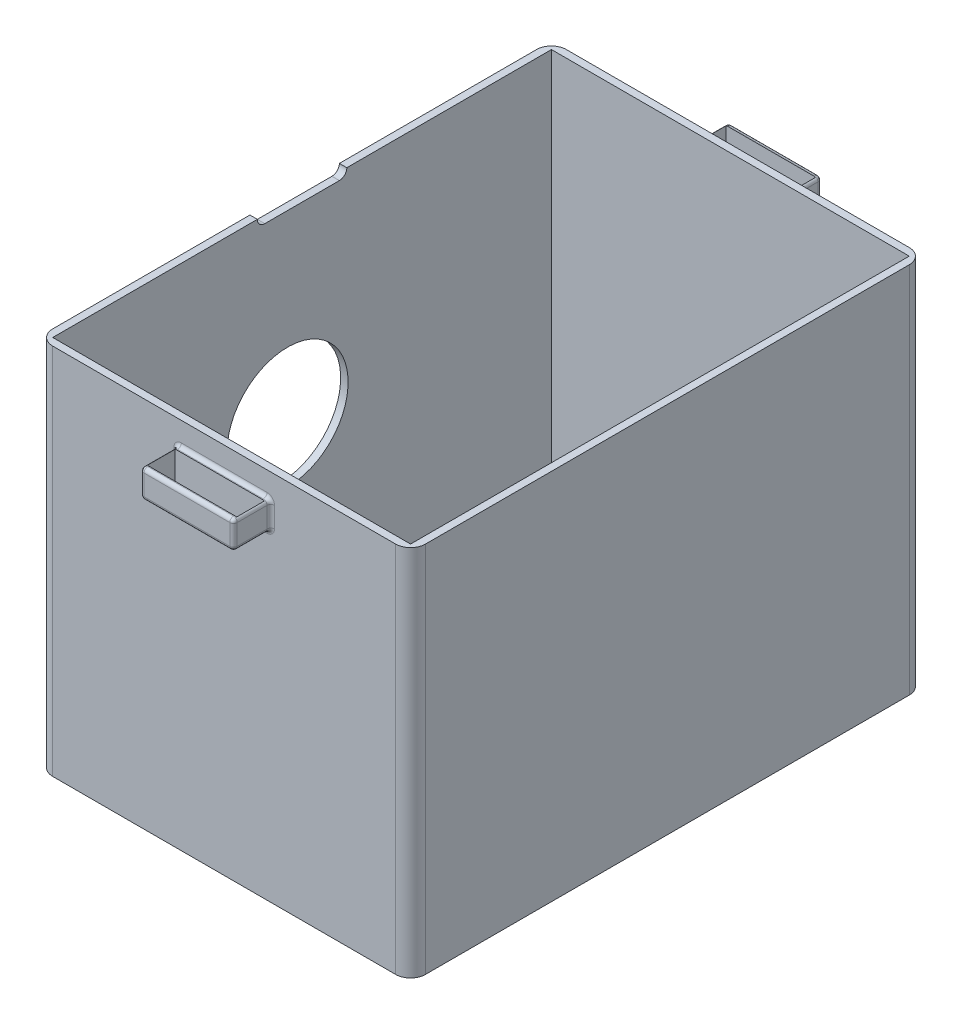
ISO-10303-21;
HEADER;
FILE_DESCRIPTION(('STEP AP214'),'2;1');
FILE_NAME('part.step','',(''),(''),'','','');
FILE_SCHEMA(('AUTOMOTIVE_DESIGN { 1 0 10303 214 1 1 1 1 }'));
ENDSEC;
DATA;
#1=APPLICATION_CONTEXT('core data for automotive mechanical design processes');
#2=APPLICATION_PROTOCOL_DEFINITION('international standard','automotive_design',2000,#1);
#3=PRODUCT_CONTEXT('',#1,'mechanical');
#4=PRODUCT('Part','Part','',(#3));
#5=PRODUCT_RELATED_PRODUCT_CATEGORY('part','',(#4));
#6=PRODUCT_DEFINITION_FORMATION('','',#4);
#7=PRODUCT_DEFINITION_CONTEXT('part definition',#1,'design');
#8=PRODUCT_DEFINITION('design','',#6,#7);
#9=PRODUCT_DEFINITION_SHAPE('','',#8);
#10=(LENGTH_UNIT() NAMED_UNIT(*) SI_UNIT(.MILLI.,.METRE.));
#11=(NAMED_UNIT(*) PLANE_ANGLE_UNIT() SI_UNIT($,.RADIAN.));
#12=(NAMED_UNIT(*) SI_UNIT($,.STERADIAN.) SOLID_ANGLE_UNIT());
#13=UNCERTAINTY_MEASURE_WITH_UNIT(LENGTH_MEASURE(1.E-05),#10,'distance_accuracy_value','');
#14=(GEOMETRIC_REPRESENTATION_CONTEXT(3) GLOBAL_UNCERTAINTY_ASSIGNED_CONTEXT((#13)) GLOBAL_UNIT_ASSIGNED_CONTEXT((#10,
#11,#12)) REPRESENTATION_CONTEXT('',''));
#15=CARTESIAN_POINT('',(0.,0.,0.));
#16=DIRECTION('',(0.,0.,1.));
#17=DIRECTION('',(1.,0.,0.));
#18=AXIS2_PLACEMENT_3D('',#15,#16,#17);
#19=CARTESIAN_POINT('',(158.75,241.3,-375.412));
#20=DIRECTION('',(0.,-1.,0.));
#21=DIRECTION('',(0.,0.,-1.));
#22=AXIS2_PLACEMENT_3D('',#19,#20,#21);
#23=PLANE('',#22);
#24=DIRECTION('',(1.,0.,0.));
#25=VECTOR('',#24,1.);
#26=CARTESIAN_POINT('',(96.52,241.3,-353.314));
#27=LINE('',#26,#25);
#28=CARTESIAN_POINT('',(97.79,241.3,-353.314));
#29=VERTEX_POINT('',#28);
#30=CARTESIAN_POINT('',(156.21,241.3,-353.314));
#31=VERTEX_POINT('',#30);
#32=EDGE_CURVE('E903',#29,#31,#27,.T.);
#33=ORIENTED_EDGE('',*,*,#32,.F.);
#34=DIRECTION('',(0.,0.,1.));
#35=VECTOR('',#34,1.);
#36=CARTESIAN_POINT('',(97.79,241.3,-375.412));
#37=LINE('',#36,#35);
#38=CARTESIAN_POINT('',(97.79,241.3,-352.552));
#39=VERTEX_POINT('',#38);
#40=EDGE_CURVE('E795',#29,#39,#37,.T.);
#41=ORIENTED_EDGE('',*,*,#40,.T.);
#42=DIRECTION('',(1.,0.,0.));
#43=VECTOR('',#42,1.);
#44=CARTESIAN_POINT('',(158.75,241.3,-352.552));
#45=LINE('',#44,#43);
#46=CARTESIAN_POINT('',(156.21,241.3,-352.552));
#47=VERTEX_POINT('',#46);
#48=EDGE_CURVE('E792',#39,#47,#45,.T.);
#49=ORIENTED_EDGE('',*,*,#48,.T.);
#50=DIRECTION('',(0.,0.,1.));
#51=VECTOR('',#50,1.);
#52=CARTESIAN_POINT('',(156.21,241.3,-375.412));
#53=LINE('',#52,#51);
#54=EDGE_CURVE('E790',#47,#31,#53,.F.);
#55=ORIENTED_EDGE('',*,*,#54,.T.);
#56=EDGE_LOOP('',(#33,#41,#49,#55));
#57=FACE_BOUND('',#56,.T.);
#58=ADVANCED_FACE('F41',(#57),#23,.F.);
#59=CARTESIAN_POINT('',(158.75,215.9,-375.412));
#60=DIRECTION('',(0.,1.,0.));
#61=DIRECTION('',(0.,0.,1.));
#62=AXIS2_PLACEMENT_3D('',#59,#60,#61);
#63=PLANE('',#62);
#64=DIRECTION('',(1.,0.,0.));
#65=VECTOR('',#64,1.);
#66=CARTESIAN_POINT('',(158.75,215.9,-353.314));
#67=LINE('',#66,#65);
#68=CARTESIAN_POINT('',(97.79,215.9,-353.314));
#69=VERTEX_POINT('',#68);
#70=CARTESIAN_POINT('',(156.21,215.9,-353.314));
#71=VERTEX_POINT('',#70);
#72=EDGE_CURVE('E739',#69,#71,#67,.T.);
#73=ORIENTED_EDGE('',*,*,#72,.T.);
#74=DIRECTION('',(0.,0.,1.));
#75=VECTOR('',#74,1.);
#76=CARTESIAN_POINT('',(156.21,215.9,-375.412));
#77=LINE('',#76,#75);
#78=CARTESIAN_POINT('',(156.21,215.9,-352.552));
#79=VERTEX_POINT('',#78);
#80=EDGE_CURVE('E782',#71,#79,#77,.T.);
#81=ORIENTED_EDGE('',*,*,#80,.T.);
#82=DIRECTION('',(-1.,0.,0.));
#83=VECTOR('',#82,1.);
#84=CARTESIAN_POINT('',(95.25,215.9,-352.552));
#85=LINE('',#84,#83);
#86=CARTESIAN_POINT('',(97.79,215.9,-352.552));
#87=VERTEX_POINT('',#86);
#88=EDGE_CURVE('E779',#79,#87,#85,.T.);
#89=ORIENTED_EDGE('',*,*,#88,.T.);
#90=DIRECTION('',(0.,0.,1.));
#91=VECTOR('',#90,1.);
#92=CARTESIAN_POINT('',(97.79,215.9,-375.412));
#93=LINE('',#92,#91);
#94=EDGE_CURVE('E777',#87,#69,#93,.F.);
#95=ORIENTED_EDGE('',*,*,#94,.T.);
#96=EDGE_LOOP('',(#73,#81,#89,#95));
#97=FACE_BOUND('',#96,.T.);
#98=ADVANCED_FACE('F1041',(#97),#63,.F.);
#99=CARTESIAN_POINT('',(0.,254.,-350.012));
#100=DIRECTION('',(0.,0.,1.));
#101=DIRECTION('',(1.,0.,0.));
#102=AXIS2_PLACEMENT_3D('',#99,#100,#101);
#103=PLANE('',#102);
#104=DIRECTION('',(-1.,0.,0.));
#105=VECTOR('',#104,1.);
#106=CARTESIAN_POINT('',(0.,254.,-350.012));
#107=LINE('',#106,#105);
#108=CARTESIAN_POINT('',(243.84,254.,-350.012));
#109=VERTEX_POINT('',#108);
#110=CARTESIAN_POINT('',(10.16,254.,-350.012));
#111=VERTEX_POINT('',#110);
#112=EDGE_CURVE('E504',#109,#111,#107,.T.);
#113=ORIENTED_EDGE('',*,*,#112,.F.);
#114=DIRECTION('',(0.,-1.,0.));
#115=VECTOR('',#114,1.);
#116=CARTESIAN_POINT('',(243.84,254.,-350.012));
#117=LINE('',#116,#115);
#118=CARTESIAN_POINT('',(243.84,0.,-350.012));
#119=VERTEX_POINT('',#118);
#120=EDGE_CURVE('E522',#109,#119,#117,.T.);
#121=ORIENTED_EDGE('',*,*,#120,.T.);
#122=DIRECTION('',(-1.,0.,0.));
#123=VECTOR('',#122,1.);
#124=CARTESIAN_POINT('',(0.,0.,-350.012));
#125=LINE('',#124,#123);
#126=CARTESIAN_POINT('',(10.16,0.,-350.012));
#127=VERTEX_POINT('',#126);
#128=EDGE_CURVE('E516',#119,#127,#125,.T.);
#129=ORIENTED_EDGE('',*,*,#128,.T.);
#130=DIRECTION('',(0.,-1.,0.));
#131=VECTOR('',#130,1.);
#132=CARTESIAN_POINT('',(10.16,254.,-350.012));
#133=LINE('',#132,#131);
#134=EDGE_CURVE('E507',#127,#111,#133,.F.);
#135=ORIENTED_EDGE('',*,*,#134,.T.);
#136=EDGE_LOOP('',(#113,#121,#129,#135));
#137=FACE_BOUND('',#136,.T.);
#138=CARTESIAN_POINT('',(156.21,218.44,-350.012));
#139=DIRECTION('',(0.,0.,1.));
#140=DIRECTION('',(1.,0.,0.));
#141=AXIS2_PLACEMENT_3D('',#138,#139,#140);
#142=CIRCLE('',#141,5.08);
#143=CARTESIAN_POINT('',(161.29,218.44,-350.012));
#144=VERTEX_POINT('',#143);
#145=CARTESIAN_POINT('',(156.21,213.36,-350.012));
#146=VERTEX_POINT('',#145);
#147=EDGE_CURVE('E768',#144,#146,#142,.F.);
#148=ORIENTED_EDGE('',*,*,#147,.F.);
#149=DIRECTION('',(0.,-1.,0.));
#150=VECTOR('',#149,1.);
#151=CARTESIAN_POINT('',(161.29,241.3,-350.012));
#152=LINE('',#151,#150);
#153=CARTESIAN_POINT('',(161.29,238.76,-350.012));
#154=VERTEX_POINT('',#153);
#155=EDGE_CURVE('E765',#144,#154,#152,.F.);
#156=ORIENTED_EDGE('',*,*,#155,.T.);
#157=CARTESIAN_POINT('',(156.21,238.76,-350.012));
#158=DIRECTION('',(0.,0.,1.));
#159=DIRECTION('',(1.,0.,0.));
#160=AXIS2_PLACEMENT_3D('',#157,#158,#159);
#161=CIRCLE('',#160,5.08);
#162=CARTESIAN_POINT('',(156.21,243.84,-350.012));
#163=VERTEX_POINT('',#162);
#164=EDGE_CURVE('E762',#163,#154,#161,.F.);
#165=ORIENTED_EDGE('',*,*,#164,.F.);
#166=DIRECTION('',(1.,0.,0.));
#167=VECTOR('',#166,1.);
#168=CARTESIAN_POINT('',(95.25,243.84,-350.012));
#169=LINE('',#168,#167);
#170=CARTESIAN_POINT('',(97.79,243.84,-350.012));
#171=VERTEX_POINT('',#170);
#172=EDGE_CURVE('E758',#163,#171,#169,.F.);
#173=ORIENTED_EDGE('',*,*,#172,.T.);
#174=CARTESIAN_POINT('',(97.79,238.76,-350.012));
#175=DIRECTION('',(0.,0.,1.));
#176=DIRECTION('',(1.,0.,0.));
#177=AXIS2_PLACEMENT_3D('',#174,#175,#176);
#178=CIRCLE('',#177,5.08);
#179=CARTESIAN_POINT('',(92.71,238.76,-350.012));
#180=VERTEX_POINT('',#179);
#181=EDGE_CURVE('E755',#180,#171,#178,.F.);
#182=ORIENTED_EDGE('',*,*,#181,.F.);
#183=DIRECTION('',(0.,1.,0.));
#184=VECTOR('',#183,1.);
#185=CARTESIAN_POINT('',(92.71,215.9,-350.012));
#186=LINE('',#185,#184);
#187=CARTESIAN_POINT('',(92.71,218.44,-350.012));
#188=VERTEX_POINT('',#187);
#189=EDGE_CURVE('E753',#180,#188,#186,.F.);
#190=ORIENTED_EDGE('',*,*,#189,.T.);
#191=CARTESIAN_POINT('',(97.79,218.44,-350.012));
#192=DIRECTION('',(0.,0.,1.));
#193=DIRECTION('',(1.,0.,0.));
#194=AXIS2_PLACEMENT_3D('',#191,#192,#193);
#195=CIRCLE('',#194,5.08);
#196=CARTESIAN_POINT('',(97.79,213.36,-350.012));
#197=VERTEX_POINT('',#196);
#198=EDGE_CURVE('E751',#197,#188,#195,.F.);
#199=ORIENTED_EDGE('',*,*,#198,.F.);
#200=DIRECTION('',(-1.,0.,0.));
#201=VECTOR('',#200,1.);
#202=CARTESIAN_POINT('',(158.75,213.36,-350.012));
#203=LINE('',#202,#201);
#204=EDGE_CURVE('E760',#197,#146,#203,.F.);
#205=ORIENTED_EDGE('',*,*,#204,.T.);
#206=EDGE_LOOP('',(#148,#156,#165,#173,#182,#190,#199,#205));
#207=FACE_BOUND('',#206,.T.);
#208=ADVANCED_FACE('F1020',(#137,#207),#103,.F.);
#209=CARTESIAN_POINT('',(95.25,219.075,25.4));
#210=DIRECTION('',(0.,1.,0.));
#211=DIRECTION('',(0.,0.,1.));
#212=AXIS2_PLACEMENT_3D('',#209,#210,#211);
#213=PLANE('',#212);
#214=DIRECTION('',(-1.,0.,0.));
#215=VECTOR('',#214,1.);
#216=CARTESIAN_POINT('',(95.25,219.075,3.175));
#217=LINE('',#216,#215);
#218=CARTESIAN_POINT('',(156.21,219.075,3.175));
#219=VERTEX_POINT('',#218);
#220=CARTESIAN_POINT('',(97.79,219.075,3.175));
#221=VERTEX_POINT('',#220);
#222=EDGE_CURVE('E563',#219,#221,#217,.T.);
#223=ORIENTED_EDGE('',*,*,#222,.T.);
#224=DIRECTION('',(0.,0.,-1.));
#225=VECTOR('',#224,1.);
#226=CARTESIAN_POINT('',(97.79,219.075,25.4));
#227=LINE('',#226,#225);
#228=CARTESIAN_POINT('',(97.79,219.075,2.54));
#229=VERTEX_POINT('',#228);
#230=EDGE_CURVE('E632',#221,#229,#227,.T.);
#231=ORIENTED_EDGE('',*,*,#230,.T.);
#232=DIRECTION('',(1.,0.,0.));
#233=VECTOR('',#232,1.);
#234=CARTESIAN_POINT('',(158.75,219.075,2.54));
#235=LINE('',#234,#233);
#236=CARTESIAN_POINT('',(156.21,219.075,2.54));
#237=VERTEX_POINT('',#236);
#238=EDGE_CURVE('E629',#229,#237,#235,.T.);
#239=ORIENTED_EDGE('',*,*,#238,.T.);
#240=DIRECTION('',(0.,0.,-1.));
#241=VECTOR('',#240,1.);
#242=CARTESIAN_POINT('',(156.21,219.075,25.4));
#243=LINE('',#242,#241);
#244=EDGE_CURVE('E627',#237,#219,#243,.F.);
#245=ORIENTED_EDGE('',*,*,#244,.T.);
#246=EDGE_LOOP('',(#223,#231,#239,#245));
#247=FACE_BOUND('',#246,.T.);
#248=ADVANCED_FACE('F1467',(#247),#213,.F.);
#249=CARTESIAN_POINT('',(0.,254.,0.));
#250=DIRECTION('',(0.,0.,-1.));
#251=DIRECTION('',(-1.,0.,0.));
#252=AXIS2_PLACEMENT_3D('',#249,#250,#251);
#253=PLANE('',#252);
#254=DIRECTION('',(1.,0.,0.));
#255=VECTOR('',#254,1.);
#256=CARTESIAN_POINT('',(0.,254.,0.));
#257=LINE('',#256,#255);
#258=CARTESIAN_POINT('',(10.16,254.,0.));
#259=VERTEX_POINT('',#258);
#260=CARTESIAN_POINT('',(243.84,254.,0.));
#261=VERTEX_POINT('',#260);
#262=EDGE_CURVE('E497',#259,#261,#257,.T.);
#263=ORIENTED_EDGE('',*,*,#262,.F.);
#264=DIRECTION('',(0.,-1.,0.));
#265=VECTOR('',#264,1.);
#266=CARTESIAN_POINT('',(10.16,254.,0.));
#267=LINE('',#266,#265);
#268=CARTESIAN_POINT('',(10.16,0.,0.));
#269=VERTEX_POINT('',#268);
#270=EDGE_CURVE('E554',#259,#269,#267,.T.);
#271=ORIENTED_EDGE('',*,*,#270,.T.);
#272=DIRECTION('',(1.,0.,0.));
#273=VECTOR('',#272,1.);
#274=CARTESIAN_POINT('',(0.,0.,0.));
#275=LINE('',#274,#273);
#276=CARTESIAN_POINT('',(243.84,0.,0.));
#277=VERTEX_POINT('',#276);
#278=EDGE_CURVE('E510',#269,#277,#275,.T.);
#279=ORIENTED_EDGE('',*,*,#278,.T.);
#280=DIRECTION('',(0.,-1.,0.));
#281=VECTOR('',#280,1.);
#282=CARTESIAN_POINT('',(243.84,254.,0.));
#283=LINE('',#282,#281);
#284=EDGE_CURVE('E552',#277,#261,#283,.F.);
#285=ORIENTED_EDGE('',*,*,#284,.T.);
#286=EDGE_LOOP('',(#263,#271,#279,#285));
#287=FACE_BOUND('',#286,.T.);
#288=CARTESIAN_POINT('',(97.79,235.585,0.));
#289=DIRECTION('',(0.,0.,-1.));
#290=DIRECTION('',(-1.,0.,0.));
#291=AXIS2_PLACEMENT_3D('',#288,#289,#290);
#292=CIRCLE('',#291,5.08);
#293=CARTESIAN_POINT('',(97.79,240.665,0.));
#294=VERTEX_POINT('',#293);
#295=CARTESIAN_POINT('',(92.71,235.585,0.));
#296=VERTEX_POINT('',#295);
#297=EDGE_CURVE('E600',#294,#296,#292,.F.);
#298=ORIENTED_EDGE('',*,*,#297,.F.);
#299=DIRECTION('',(-1.,0.,0.));
#300=VECTOR('',#299,1.);
#301=CARTESIAN_POINT('',(158.75,240.665,0.));
#302=LINE('',#301,#300);
#303=CARTESIAN_POINT('',(156.21,240.665,0.));
#304=VERTEX_POINT('',#303);
#305=EDGE_CURVE('E597',#294,#304,#302,.F.);
#306=ORIENTED_EDGE('',*,*,#305,.T.);
#307=CARTESIAN_POINT('',(156.21,235.585,0.));
#308=DIRECTION('',(0.,0.,-1.));
#309=DIRECTION('',(-1.,0.,0.));
#310=AXIS2_PLACEMENT_3D('',#307,#308,#309);
#311=CIRCLE('',#310,5.08);
#312=CARTESIAN_POINT('',(161.29,235.585,0.));
#313=VERTEX_POINT('',#312);
#314=EDGE_CURVE('E594',#313,#304,#311,.F.);
#315=ORIENTED_EDGE('',*,*,#314,.F.);
#316=DIRECTION('',(0.,1.,0.));
#317=VECTOR('',#316,1.);
#318=CARTESIAN_POINT('',(161.29,219.075,0.));
#319=LINE('',#318,#317);
#320=CARTESIAN_POINT('',(161.29,221.615,0.));
#321=VERTEX_POINT('',#320);
#322=EDGE_CURVE('E590',#313,#321,#319,.F.);
#323=ORIENTED_EDGE('',*,*,#322,.T.);
#324=CARTESIAN_POINT('',(156.21,221.615,0.));
#325=DIRECTION('',(0.,0.,-1.));
#326=DIRECTION('',(-1.,0.,0.));
#327=AXIS2_PLACEMENT_3D('',#324,#325,#326);
#328=CIRCLE('',#327,5.08);
#329=CARTESIAN_POINT('',(156.21,216.535,0.));
#330=VERTEX_POINT('',#329);
#331=EDGE_CURVE('E587',#330,#321,#328,.F.);
#332=ORIENTED_EDGE('',*,*,#331,.F.);
#333=DIRECTION('',(1.,0.,0.));
#334=VECTOR('',#333,1.);
#335=CARTESIAN_POINT('',(95.25,216.535,0.));
#336=LINE('',#335,#334);
#337=CARTESIAN_POINT('',(97.79,216.535,0.));
#338=VERTEX_POINT('',#337);
#339=EDGE_CURVE('E585',#330,#338,#336,.F.);
#340=ORIENTED_EDGE('',*,*,#339,.T.);
#341=CARTESIAN_POINT('',(97.79,221.615,0.));
#342=DIRECTION('',(0.,0.,-1.));
#343=DIRECTION('',(-1.,0.,0.));
#344=AXIS2_PLACEMENT_3D('',#341,#342,#343);
#345=CIRCLE('',#344,5.08);
#346=CARTESIAN_POINT('',(92.71,221.615,0.));
#347=VERTEX_POINT('',#346);
#348=EDGE_CURVE('E582',#347,#338,#345,.F.);
#349=ORIENTED_EDGE('',*,*,#348,.F.);
#350=DIRECTION('',(0.,-1.,0.));
#351=VECTOR('',#350,1.);
#352=CARTESIAN_POINT('',(92.71,238.125,0.));
#353=LINE('',#352,#351);
#354=EDGE_CURVE('E592',#347,#296,#353,.F.);
#355=ORIENTED_EDGE('',*,*,#354,.T.);
#356=EDGE_LOOP('',(#298,#306,#315,#323,#332,#340,#349,#355));
#357=FACE_BOUND('',#356,.T.);
#358=ADVANCED_FACE('F1001',(#287,#357),#253,.F.);
#359=CARTESIAN_POINT('',(95.25,238.125,25.4));
#360=DIRECTION('',(0.,-1.,0.));
#361=DIRECTION('',(0.,0.,-1.));
#362=AXIS2_PLACEMENT_3D('',#359,#360,#361);
#363=PLANE('',#362);
#364=DIRECTION('',(-1.,0.,0.));
#365=VECTOR('',#364,1.);
#366=CARTESIAN_POINT('',(95.25,238.125,2.54));
#367=LINE('',#366,#365);
#368=CARTESIAN_POINT('',(156.21,238.125,2.54));
#369=VERTEX_POINT('',#368);
#370=CARTESIAN_POINT('',(97.79,238.125,2.54));
#371=VERTEX_POINT('',#370);
#372=EDGE_CURVE('E577',#369,#371,#367,.T.);
#373=ORIENTED_EDGE('',*,*,#372,.T.);
#374=DIRECTION('',(0.,0.,-1.));
#375=VECTOR('',#374,1.);
#376=CARTESIAN_POINT('',(97.79,238.125,25.4));
#377=LINE('',#376,#375);
#378=CARTESIAN_POINT('',(97.79,238.125,3.175));
#379=VERTEX_POINT('',#378);
#380=EDGE_CURVE('E580',#371,#379,#377,.F.);
#381=ORIENTED_EDGE('',*,*,#380,.T.);
#382=DIRECTION('',(-1.,0.,0.));
#383=VECTOR('',#382,1.);
#384=CARTESIAN_POINT('',(96.52,238.125,3.175));
#385=LINE('',#384,#383);
#386=CARTESIAN_POINT('',(156.21,238.125,3.175));
#387=VERTEX_POINT('',#386);
#388=EDGE_CURVE('E736',#387,#379,#385,.T.);
#389=ORIENTED_EDGE('',*,*,#388,.F.);
#390=DIRECTION('',(0.,0.,-1.));
#391=VECTOR('',#390,1.);
#392=CARTESIAN_POINT('',(156.21,238.125,25.4));
#393=LINE('',#392,#391);
#394=EDGE_CURVE('E575',#387,#369,#393,.T.);
#395=ORIENTED_EDGE('',*,*,#394,.T.);
#396=EDGE_LOOP('',(#373,#381,#389,#395));
#397=FACE_BOUND('',#396,.T.);
#398=ADVANCED_FACE('F1483',(#397),#363,.F.);
#399=CARTESIAN_POINT('',(0.,254.,0.));
#400=DIRECTION('',(1.,0.,0.));
#401=DIRECTION('',(0.,0.,-1.));
#402=AXIS2_PLACEMENT_3D('',#399,#400,#401);
#403=PLANE('',#402);
#404=CARTESIAN_POINT('',(0.,127.,-165.1));
#405=DIRECTION('',(-1.,0.,0.));
#406=DIRECTION('',(0.,0.,1.));
#407=AXIS2_PLACEMENT_3D('',#404,#405,#406);
#408=CIRCLE('',#407,41.275);
#409=CARTESIAN_POINT('',(0.,127.,-123.825));
#410=VERTEX_POINT('',#409);
#411=EDGE_CURVE('E456',#410,#410,#408,.T.);
#412=ORIENTED_EDGE('',*,*,#411,.F.);
#413=EDGE_LOOP('',(#412));
#414=FACE_BOUND('',#413,.T.);
#415=DIRECTION('',(0.,0.,1.));
#416=VECTOR('',#415,1.);
#417=CARTESIAN_POINT('',(0.,248.92,-200.406));
#418=LINE('',#417,#416);
#419=CARTESIAN_POINT('',(0.,248.92,-200.406));
#420=VERTEX_POINT('',#419);
#421=CARTESIAN_POINT('',(0.,248.92,-149.606));
#422=VERTEX_POINT('',#421);
#423=EDGE_CURVE('E433',#420,#422,#418,.T.);
#424=ORIENTED_EDGE('',*,*,#423,.F.);
#425=CARTESIAN_POINT('',(0.,254.,-200.406));
#426=DIRECTION('',(-1.,0.,0.));
#427=DIRECTION('',(0.,0.,1.));
#428=AXIS2_PLACEMENT_3D('',#425,#426,#427);
#429=CIRCLE('',#428,5.07999999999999);
#430=CARTESIAN_POINT('',(0.,254.,-205.486));
#431=VERTEX_POINT('',#430);
#432=EDGE_CURVE('E422',#431,#420,#429,.T.);
#433=ORIENTED_EDGE('',*,*,#432,.F.);
#434=DIRECTION('',(0.,0.,1.));
#435=VECTOR('',#434,1.);
#436=CARTESIAN_POINT('',(0.,254.,0.));
#437=LINE('',#436,#435);
#438=CARTESIAN_POINT('',(0.,254.,-339.852));
#439=VERTEX_POINT('',#438);
#440=EDGE_CURVE('E495',#439,#431,#437,.T.);
#441=ORIENTED_EDGE('',*,*,#440,.F.);
#442=DIRECTION('',(0.,-1.,0.));
#443=VECTOR('',#442,1.);
#444=CARTESIAN_POINT('',(0.,254.,-339.852));
#445=LINE('',#444,#443);
#446=CARTESIAN_POINT('',(0.,0.,-339.852));
#447=VERTEX_POINT('',#446);
#448=EDGE_CURVE('E549',#439,#447,#445,.T.);
#449=ORIENTED_EDGE('',*,*,#448,.T.);
#450=DIRECTION('',(0.,0.,1.));
#451=VECTOR('',#450,1.);
#452=CARTESIAN_POINT('',(0.,0.,0.));
#453=LINE('',#452,#451);
#454=CARTESIAN_POINT('',(0.,0.,-10.16));
#455=VERTEX_POINT('',#454);
#456=EDGE_CURVE('E488',#447,#455,#453,.T.);
#457=ORIENTED_EDGE('',*,*,#456,.T.);
#458=DIRECTION('',(0.,-1.,0.));
#459=VECTOR('',#458,1.);
#460=CARTESIAN_POINT('',(0.,254.,-10.16));
#461=LINE('',#460,#459);
#462=CARTESIAN_POINT('',(0.,254.,-10.16));
#463=VERTEX_POINT('',#462);
#464=EDGE_CURVE('E546',#455,#463,#461,.F.);
#465=ORIENTED_EDGE('',*,*,#464,.T.);
#466=CARTESIAN_POINT('',(0.,254.,-144.526));
#467=VERTEX_POINT('',#466);
#468=EDGE_CURVE('E498',#467,#463,#437,.T.);
#469=ORIENTED_EDGE('',*,*,#468,.F.);
#470=CARTESIAN_POINT('',(0.,254.,-149.606));
#471=DIRECTION('',(-1.,0.,0.));
#472=DIRECTION('',(0.,0.,1.));
#473=AXIS2_PLACEMENT_3D('',#470,#471,#472);
#474=CIRCLE('',#473,5.07999999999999);
#475=EDGE_CURVE('E443',#422,#467,#474,.T.);
#476=ORIENTED_EDGE('',*,*,#475,.F.);
#477=EDGE_LOOP('',(#424,#433,#441,#449,#457,#465,#469,#476));
#478=FACE_BOUND('',#477,.T.);
#479=ADVANCED_FACE('F445',(#414,#478),#403,.F.);
#480=CARTESIAN_POINT('',(254.,254.,0.));
#481=DIRECTION('',(-1.,0.,0.));
#482=DIRECTION('',(0.,0.,1.));
#483=AXIS2_PLACEMENT_3D('',#480,#481,#482);
#484=PLANE('',#483);
#485=DIRECTION('',(0.,0.,-1.));
#486=VECTOR('',#485,1.);
#487=CARTESIAN_POINT('',(254.,0.,0.));
#488=LINE('',#487,#486);
#489=CARTESIAN_POINT('',(254.,0.,-10.16));
#490=VERTEX_POINT('',#489);
#491=CARTESIAN_POINT('',(254.,0.,-339.852));
#492=VERTEX_POINT('',#491);
#493=EDGE_CURVE('E513',#490,#492,#488,.T.);
#494=ORIENTED_EDGE('',*,*,#493,.T.);
#495=DIRECTION('',(0.,-1.,0.));
#496=VECTOR('',#495,1.);
#497=CARTESIAN_POINT('',(254.,254.,-339.852));
#498=LINE('',#497,#496);
#499=CARTESIAN_POINT('',(254.,254.,-339.852));
#500=VERTEX_POINT('',#499);
#501=EDGE_CURVE('E536',#492,#500,#498,.F.);
#502=ORIENTED_EDGE('',*,*,#501,.T.);
#503=DIRECTION('',(0.,0.,-1.));
#504=VECTOR('',#503,1.);
#505=CARTESIAN_POINT('',(254.,254.,0.));
#506=LINE('',#505,#504);
#507=CARTESIAN_POINT('',(254.,254.,-10.16));
#508=VERTEX_POINT('',#507);
#509=EDGE_CURVE('E501',#508,#500,#506,.T.);
#510=ORIENTED_EDGE('',*,*,#509,.F.);
#511=DIRECTION('',(0.,-1.,0.));
#512=VECTOR('',#511,1.);
#513=CARTESIAN_POINT('',(254.,254.,-10.16));
#514=LINE('',#513,#512);
#515=EDGE_CURVE('E533',#508,#490,#514,.T.);
#516=ORIENTED_EDGE('',*,*,#515,.T.);
#517=EDGE_LOOP('',(#494,#502,#510,#516));
#518=FACE_BOUND('',#517,.T.);
#519=ADVANCED_FACE('F1011',(#518),#484,.F.);
#520=CARTESIAN_POINT('',(0.,254.,0.));
#521=DIRECTION('',(0.,-1.,0.));
#522=DIRECTION('',(0.,0.,-1.));
#523=AXIS2_PLACEMENT_3D('',#520,#521,#522);
#524=PLANE('',#523);
#525=ORIENTED_EDGE('',*,*,#440,.T.);
#526=DIRECTION('',(-1.,0.,0.));
#527=VECTOR('',#526,1.);
#528=CARTESIAN_POINT('',(7.62,254.,-205.486));
#529=LINE('',#528,#527);
#530=CARTESIAN_POINT('',(5.08000000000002,254.,-205.486));
#531=VERTEX_POINT('',#530);
#532=EDGE_CURVE('E428',#431,#531,#529,.F.);
#533=ORIENTED_EDGE('',*,*,#532,.T.);
#534=DIRECTION('',(0.,0.,1.));
#535=VECTOR('',#534,1.);
#536=CARTESIAN_POINT('',(5.08,254.,-344.932));
#537=LINE('',#536,#535);
#538=CARTESIAN_POINT('',(5.08,254.,-344.932));
#539=VERTEX_POINT('',#538);
#540=EDGE_CURVE('E474',#539,#531,#537,.T.);
#541=ORIENTED_EDGE('',*,*,#540,.F.);
#542=DIRECTION('',(-1.,0.,0.));
#543=VECTOR('',#542,1.);
#544=CARTESIAN_POINT('',(5.08,254.,-344.932));
#545=LINE('',#544,#543);
#546=CARTESIAN_POINT('',(248.92,254.,-344.932));
#547=VERTEX_POINT('',#546);
#548=EDGE_CURVE('E464',#547,#539,#545,.T.);
#549=ORIENTED_EDGE('',*,*,#548,.F.);
#550=DIRECTION('',(0.,0.,-1.));
#551=VECTOR('',#550,1.);
#552=CARTESIAN_POINT('',(248.92,254.,-344.932));
#553=LINE('',#552,#551);
#554=CARTESIAN_POINT('',(248.92,254.,-5.08));
#555=VERTEX_POINT('',#554);
#556=EDGE_CURVE('E481',#555,#547,#553,.T.);
#557=ORIENTED_EDGE('',*,*,#556,.F.);
#558=DIRECTION('',(1.,0.,0.));
#559=VECTOR('',#558,1.);
#560=CARTESIAN_POINT('',(5.08000000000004,254.,-5.08));
#561=LINE('',#560,#559);
#562=CARTESIAN_POINT('',(5.08000000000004,254.,-5.08));
#563=VERTEX_POINT('',#562);
#564=EDGE_CURVE('E477',#563,#555,#561,.T.);
#565=ORIENTED_EDGE('',*,*,#564,.F.);
#566=CARTESIAN_POINT('',(5.08000000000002,254.,-144.526));
#567=VERTEX_POINT('',#566);
#568=EDGE_CURVE('E478',#567,#563,#537,.T.);
#569=ORIENTED_EDGE('',*,*,#568,.F.);
#570=DIRECTION('',(-1.,0.,0.));
#571=VECTOR('',#570,1.);
#572=CARTESIAN_POINT('',(7.62,254.,-144.526));
#573=LINE('',#572,#571);
#574=EDGE_CURVE('E451',#567,#467,#573,.T.);
#575=ORIENTED_EDGE('',*,*,#574,.T.);
#576=ORIENTED_EDGE('',*,*,#468,.T.);
#577=CARTESIAN_POINT('',(10.16,254.,-10.16));
#578=DIRECTION('',(0.,-1.,0.));
#579=DIRECTION('',(0.,0.,-1.));
#580=AXIS2_PLACEMENT_3D('',#577,#578,#579);
#581=CIRCLE('',#580,10.16);
#582=EDGE_CURVE('E540',#463,#259,#581,.F.);
#583=ORIENTED_EDGE('',*,*,#582,.T.);
#584=ORIENTED_EDGE('',*,*,#262,.T.);
#585=CARTESIAN_POINT('',(243.84,254.,-10.16));
#586=DIRECTION('',(0.,-1.,0.));
#587=DIRECTION('',(0.,0.,-1.));
#588=AXIS2_PLACEMENT_3D('',#585,#586,#587);
#589=CIRCLE('',#588,10.16);
#590=EDGE_CURVE('E538',#261,#508,#589,.F.);
#591=ORIENTED_EDGE('',*,*,#590,.T.);
#592=ORIENTED_EDGE('',*,*,#509,.T.);
#593=CARTESIAN_POINT('',(243.84,254.,-339.852));
#594=DIRECTION('',(0.,-1.,0.));
#595=DIRECTION('',(0.,0.,-1.));
#596=AXIS2_PLACEMENT_3D('',#593,#594,#595);
#597=CIRCLE('',#596,10.16);
#598=EDGE_CURVE('E544',#500,#109,#597,.F.);
#599=ORIENTED_EDGE('',*,*,#598,.T.);
#600=ORIENTED_EDGE('',*,*,#112,.T.);
#601=CARTESIAN_POINT('',(10.16,254.,-339.852));
#602=DIRECTION('',(0.,-1.,0.));
#603=DIRECTION('',(0.,0.,-1.));
#604=AXIS2_PLACEMENT_3D('',#601,#602,#603);
#605=CIRCLE('',#604,10.16);
#606=EDGE_CURVE('E542',#111,#439,#605,.F.);
#607=ORIENTED_EDGE('',*,*,#606,.T.);
#608=EDGE_LOOP('',(#525,#533,#541,#549,#557,#565,#569,#575,#576,#583,#584,#591,#592,#599,#600,#607));
#609=FACE_BOUND('',#608,.T.);
#610=ADVANCED_FACE('F989',(#609),#524,.F.);
#611=CARTESIAN_POINT('',(0.,0.,0.));
#612=DIRECTION('',(0.,-1.,0.));
#613=DIRECTION('',(0.,0.,-1.));
#614=AXIS2_PLACEMENT_3D('',#611,#612,#613);
#615=PLANE('',#614);
#616=CARTESIAN_POINT('',(50.8,0.,-50.8));
#617=DIRECTION('',(0.,1.,0.));
#618=DIRECTION('',(0.,0.,1.));
#619=AXIS2_PLACEMENT_3D('',#616,#617,#618);
#620=CIRCLE('',#619,2.54);
#621=CARTESIAN_POINT('',(50.8,0.,-48.26));
#622=VERTEX_POINT('',#621);
#623=EDGE_CURVE('E953',#622,#622,#620,.T.);
#624=ORIENTED_EDGE('',*,*,#623,.T.);
#625=EDGE_LOOP('',(#624));
#626=FACE_BOUND('',#625,.T.);
#627=CARTESIAN_POINT('',(203.2,0.,-50.8));
#628=DIRECTION('',(0.,1.,0.));
#629=DIRECTION('',(0.,0.,1.));
#630=AXIS2_PLACEMENT_3D('',#627,#628,#629);
#631=CIRCLE('',#630,2.53999999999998);
#632=CARTESIAN_POINT('',(203.2,0.,-48.26));
#633=VERTEX_POINT('',#632);
#634=EDGE_CURVE('E947',#633,#633,#631,.T.);
#635=ORIENTED_EDGE('',*,*,#634,.T.);
#636=EDGE_LOOP('',(#635));
#637=FACE_BOUND('',#636,.T.);
#638=CARTESIAN_POINT('',(203.2,0.,-299.212));
#639=DIRECTION('',(0.,1.,0.));
#640=DIRECTION('',(0.,0.,1.));
#641=AXIS2_PLACEMENT_3D('',#638,#639,#640);
#642=CIRCLE('',#641,2.53999999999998);
#643=CARTESIAN_POINT('',(203.2,0.,-296.672));
#644=VERTEX_POINT('',#643);
#645=EDGE_CURVE('E940',#644,#644,#642,.T.);
#646=ORIENTED_EDGE('',*,*,#645,.T.);
#647=EDGE_LOOP('',(#646));
#648=FACE_BOUND('',#647,.T.);
#649=CARTESIAN_POINT('',(50.8,0.,-299.212));
#650=DIRECTION('',(0.,1.,0.));
#651=DIRECTION('',(0.,0.,1.));
#652=AXIS2_PLACEMENT_3D('',#649,#650,#651);
#653=CIRCLE('',#652,2.54000000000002);
#654=CARTESIAN_POINT('',(50.8,0.,-296.672));
#655=VERTEX_POINT('',#654);
#656=EDGE_CURVE('E434',#655,#655,#653,.T.);
#657=ORIENTED_EDGE('',*,*,#656,.T.);
#658=EDGE_LOOP('',(#657));
#659=FACE_BOUND('',#658,.T.);
#660=ORIENTED_EDGE('',*,*,#128,.F.);
#661=CARTESIAN_POINT('',(243.84,0.,-339.852));
#662=DIRECTION('',(0.,-1.,0.));
#663=DIRECTION('',(0.,0.,-1.));
#664=AXIS2_PLACEMENT_3D('',#661,#662,#663);
#665=CIRCLE('',#664,10.16);
#666=EDGE_CURVE('E531',#119,#492,#665,.T.);
#667=ORIENTED_EDGE('',*,*,#666,.T.);
#668=ORIENTED_EDGE('',*,*,#493,.F.);
#669=CARTESIAN_POINT('',(243.84,0.,-10.16));
#670=DIRECTION('',(0.,-1.,0.));
#671=DIRECTION('',(0.,0.,-1.));
#672=AXIS2_PLACEMENT_3D('',#669,#670,#671);
#673=CIRCLE('',#672,10.16);
#674=EDGE_CURVE('E525',#490,#277,#673,.T.);
#675=ORIENTED_EDGE('',*,*,#674,.T.);
#676=ORIENTED_EDGE('',*,*,#278,.F.);
#677=CARTESIAN_POINT('',(10.16,0.,-10.16));
#678=DIRECTION('',(0.,-1.,0.));
#679=DIRECTION('',(0.,0.,-1.));
#680=AXIS2_PLACEMENT_3D('',#677,#678,#679);
#681=CIRCLE('',#680,10.16);
#682=EDGE_CURVE('E527',#269,#455,#681,.T.);
#683=ORIENTED_EDGE('',*,*,#682,.T.);
#684=ORIENTED_EDGE('',*,*,#456,.F.);
#685=CARTESIAN_POINT('',(10.16,0.,-339.852));
#686=DIRECTION('',(0.,-1.,0.));
#687=DIRECTION('',(0.,0.,-1.));
#688=AXIS2_PLACEMENT_3D('',#685,#686,#687);
#689=CIRCLE('',#688,10.16);
#690=EDGE_CURVE('E529',#447,#127,#689,.T.);
#691=ORIENTED_EDGE('',*,*,#690,.T.);
#692=EDGE_LOOP('',(#660,#667,#668,#675,#676,#683,#684,#691));
#693=FACE_BOUND('',#692,.T.);
#694=ADVANCED_FACE('F1028',(#626,#637,#648,#659,#693),#615,.T.);
#695=CARTESIAN_POINT('',(5.08,0.76200000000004,-344.932));
#696=DIRECTION('',(-1.,0.,0.));
#697=DIRECTION('',(0.,0.,1.));
#698=AXIS2_PLACEMENT_3D('',#695,#696,#697);
#699=PLANE('',#698);
#700=ORIENTED_EDGE('',*,*,#540,.T.);
#701=CARTESIAN_POINT('',(5.08000000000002,254.,-200.406));
#702=DIRECTION('',(-1.,0.,0.));
#703=DIRECTION('',(0.,0.,1.));
#704=AXIS2_PLACEMENT_3D('',#701,#702,#703);
#705=CIRCLE('',#704,5.07999999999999);
#706=CARTESIAN_POINT('',(5.08000000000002,248.92,-200.406));
#707=VERTEX_POINT('',#706);
#708=EDGE_CURVE('E561',#531,#707,#705,.T.);
#709=ORIENTED_EDGE('',*,*,#708,.T.);
#710=DIRECTION('',(0.,0.,1.));
#711=VECTOR('',#710,1.);
#712=CARTESIAN_POINT('',(5.08,248.92,-344.932));
#713=LINE('',#712,#711);
#714=CARTESIAN_POINT('',(5.08000000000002,248.92,-149.606));
#715=VERTEX_POINT('',#714);
#716=EDGE_CURVE('E441',#707,#715,#713,.T.);
#717=ORIENTED_EDGE('',*,*,#716,.T.);
#718=CARTESIAN_POINT('',(5.08000000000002,254.,-149.606));
#719=DIRECTION('',(-1.,0.,0.));
#720=DIRECTION('',(0.,0.,1.));
#721=AXIS2_PLACEMENT_3D('',#718,#719,#720);
#722=CIRCLE('',#721,5.07999999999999);
#723=EDGE_CURVE('E558',#715,#567,#722,.T.);
#724=ORIENTED_EDGE('',*,*,#723,.T.);
#725=ORIENTED_EDGE('',*,*,#568,.T.);
#726=DIRECTION('',(0.,1.,0.));
#727=VECTOR('',#726,1.);
#728=CARTESIAN_POINT('',(5.08000000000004,0.76200000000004,-5.08));
#729=LINE('',#728,#727);
#730=CARTESIAN_POINT('',(5.08000000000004,0.76200000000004,-5.08));
#731=VERTEX_POINT('',#730);
#732=EDGE_CURVE('E473',#731,#563,#729,.T.);
#733=ORIENTED_EDGE('',*,*,#732,.F.);
#734=DIRECTION('',(0.,0.,1.));
#735=VECTOR('',#734,1.);
#736=CARTESIAN_POINT('',(5.08,0.76200000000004,-344.932));
#737=LINE('',#736,#735);
#738=CARTESIAN_POINT('',(5.08,0.76200000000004,-344.932));
#739=VERTEX_POINT('',#738);
#740=EDGE_CURVE('E460',#739,#731,#737,.T.);
#741=ORIENTED_EDGE('',*,*,#740,.F.);
#742=DIRECTION('',(0.,1.,0.));
#743=VECTOR('',#742,1.);
#744=CARTESIAN_POINT('',(5.08,0.76200000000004,-344.932));
#745=LINE('',#744,#743);
#746=EDGE_CURVE('E486',#739,#539,#745,.T.);
#747=ORIENTED_EDGE('',*,*,#746,.T.);
#748=EDGE_LOOP('',(#700,#709,#717,#724,#725,#733,#741,#747));
#749=FACE_BOUND('',#748,.T.);
#750=CARTESIAN_POINT('',(5.08000000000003,127.,-165.1));
#751=DIRECTION('',(-1.,0.,0.));
#752=DIRECTION('',(0.,0.,1.));
#753=AXIS2_PLACEMENT_3D('',#750,#751,#752);
#754=CIRCLE('',#753,41.275);
#755=CARTESIAN_POINT('',(5.08000000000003,127.,-123.825));
#756=VERTEX_POINT('',#755);
#757=EDGE_CURVE('E459',#756,#756,#754,.T.);
#758=ORIENTED_EDGE('',*,*,#757,.T.);
#759=EDGE_LOOP('',(#758));
#760=FACE_BOUND('',#759,.T.);
#761=ADVANCED_FACE('F975',(#749,#760),#699,.F.);
#762=CARTESIAN_POINT('',(5.08,0.76200000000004,-344.932));
#763=DIRECTION('',(0.,0.,-1.));
#764=DIRECTION('',(-1.,0.,0.));
#765=AXIS2_PLACEMENT_3D('',#762,#763,#764);
#766=PLANE('',#765);
#767=ORIENTED_EDGE('',*,*,#548,.T.);
#768=ORIENTED_EDGE('',*,*,#746,.F.);
#769=DIRECTION('',(-1.,0.,0.));
#770=VECTOR('',#769,1.);
#771=CARTESIAN_POINT('',(5.08,0.76200000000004,-344.932));
#772=LINE('',#771,#770);
#773=CARTESIAN_POINT('',(248.92,0.76200000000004,-344.932));
#774=VERTEX_POINT('',#773);
#775=EDGE_CURVE('E470',#774,#739,#772,.T.);
#776=ORIENTED_EDGE('',*,*,#775,.F.);
#777=DIRECTION('',(0.,1.,0.));
#778=VECTOR('',#777,1.);
#779=CARTESIAN_POINT('',(248.92,0.76200000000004,-344.932));
#780=LINE('',#779,#778);
#781=EDGE_CURVE('E489',#774,#547,#780,.T.);
#782=ORIENTED_EDGE('',*,*,#781,.T.);
#783=EDGE_LOOP('',(#767,#768,#776,#782));
#784=FACE_BOUND('',#783,.T.);
#785=ADVANCED_FACE('F985',(#784),#766,.F.);
#786=CARTESIAN_POINT('',(248.92,0.76200000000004,-344.932));
#787=DIRECTION('',(1.,0.,0.));
#788=DIRECTION('',(0.,0.,-1.));
#789=AXIS2_PLACEMENT_3D('',#786,#787,#788);
#790=PLANE('',#789);
#791=ORIENTED_EDGE('',*,*,#556,.T.);
#792=ORIENTED_EDGE('',*,*,#781,.F.);
#793=DIRECTION('',(0.,0.,-1.));
#794=VECTOR('',#793,1.);
#795=CARTESIAN_POINT('',(248.92,0.76200000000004,-344.932));
#796=LINE('',#795,#794);
#797=CARTESIAN_POINT('',(248.92,0.76200000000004,-5.08));
#798=VERTEX_POINT('',#797);
#799=EDGE_CURVE('E467',#798,#774,#796,.T.);
#800=ORIENTED_EDGE('',*,*,#799,.F.);
#801=DIRECTION('',(0.,1.,0.));
#802=VECTOR('',#801,1.);
#803=CARTESIAN_POINT('',(248.92,0.76200000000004,-5.08));
#804=LINE('',#803,#802);
#805=EDGE_CURVE('E491',#798,#555,#804,.T.);
#806=ORIENTED_EDGE('',*,*,#805,.T.);
#807=EDGE_LOOP('',(#791,#792,#800,#806));
#808=FACE_BOUND('',#807,.T.);
#809=ADVANCED_FACE('F983',(#808),#790,.F.);
#810=CARTESIAN_POINT('',(5.08000000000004,0.76200000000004,-5.08));
#811=DIRECTION('',(0.,0.,1.));
#812=DIRECTION('',(1.,0.,0.));
#813=AXIS2_PLACEMENT_3D('',#810,#811,#812);
#814=PLANE('',#813);
#815=ORIENTED_EDGE('',*,*,#564,.T.);
#816=ORIENTED_EDGE('',*,*,#805,.F.);
#817=DIRECTION('',(1.,0.,0.));
#818=VECTOR('',#817,1.);
#819=CARTESIAN_POINT('',(5.08000000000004,0.76200000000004,-5.08));
#820=LINE('',#819,#818);
#821=EDGE_CURVE('E463',#731,#798,#820,.T.);
#822=ORIENTED_EDGE('',*,*,#821,.F.);
#823=ORIENTED_EDGE('',*,*,#732,.T.);
#824=EDGE_LOOP('',(#815,#816,#822,#823));
#825=FACE_BOUND('',#824,.T.);
#826=ADVANCED_FACE('F968',(#825),#814,.F.);
#827=CARTESIAN_POINT('',(0.,0.76200000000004,0.));
#828=DIRECTION('',(0.,1.,0.));
#829=DIRECTION('',(0.,0.,1.));
#830=AXIS2_PLACEMENT_3D('',#827,#828,#829);
#831=PLANE('',#830);
#832=CARTESIAN_POINT('',(50.8,0.76200000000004,-50.8));
#833=DIRECTION('',(0.,1.,0.));
#834=DIRECTION('',(0.,0.,1.));
#835=AXIS2_PLACEMENT_3D('',#832,#833,#834);
#836=CIRCLE('',#835,2.54);
#837=CARTESIAN_POINT('',(50.8,0.76200000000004,-48.26));
#838=VERTEX_POINT('',#837);
#839=EDGE_CURVE('E931',#838,#838,#836,.T.);
#840=ORIENTED_EDGE('',*,*,#839,.F.);
#841=EDGE_LOOP('',(#840));
#842=FACE_BOUND('',#841,.T.);
#843=CARTESIAN_POINT('',(203.2,0.76200000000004,-50.8));
#844=DIRECTION('',(0.,1.,0.));
#845=DIRECTION('',(0.,0.,1.));
#846=AXIS2_PLACEMENT_3D('',#843,#844,#845);
#847=CIRCLE('',#846,2.53999999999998);
#848=CARTESIAN_POINT('',(203.2,0.76200000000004,-48.26));
#849=VERTEX_POINT('',#848);
#850=EDGE_CURVE('E950',#849,#849,#847,.T.);
#851=ORIENTED_EDGE('',*,*,#850,.F.);
#852=EDGE_LOOP('',(#851));
#853=FACE_BOUND('',#852,.T.);
#854=CARTESIAN_POINT('',(203.2,0.76200000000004,-299.212));
#855=DIRECTION('',(0.,1.,0.));
#856=DIRECTION('',(0.,0.,1.));
#857=AXIS2_PLACEMENT_3D('',#854,#855,#856);
#858=CIRCLE('',#857,2.53999999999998);
#859=CARTESIAN_POINT('',(203.2,0.76200000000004,-296.672));
#860=VERTEX_POINT('',#859);
#861=EDGE_CURVE('E944',#860,#860,#858,.T.);
#862=ORIENTED_EDGE('',*,*,#861,.F.);
#863=EDGE_LOOP('',(#862));
#864=FACE_BOUND('',#863,.T.);
#865=CARTESIAN_POINT('',(50.8,0.76200000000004,-299.212));
#866=DIRECTION('',(0.,1.,0.));
#867=DIRECTION('',(0.,0.,1.));
#868=AXIS2_PLACEMENT_3D('',#865,#866,#867);
#869=CIRCLE('',#868,2.54000000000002);
#870=CARTESIAN_POINT('',(50.8,0.76200000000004,-296.672));
#871=VERTEX_POINT('',#870);
#872=EDGE_CURVE('E943',#871,#871,#869,.T.);
#873=ORIENTED_EDGE('',*,*,#872,.F.);
#874=EDGE_LOOP('',(#873));
#875=FACE_BOUND('',#874,.T.);
#876=ORIENTED_EDGE('',*,*,#740,.T.);
#877=ORIENTED_EDGE('',*,*,#821,.T.);
#878=ORIENTED_EDGE('',*,*,#799,.T.);
#879=ORIENTED_EDGE('',*,*,#775,.T.);
#880=EDGE_LOOP('',(#876,#877,#878,#879));
#881=FACE_BOUND('',#880,.T.);
#882=ADVANCED_FACE('F964',(#842,#853,#864,#875,#881),#831,.T.);
#883=CARTESIAN_POINT('',(241.3,127.,-165.1));
#884=DIRECTION('',(-1.,0.,0.));
#885=DIRECTION('',(0.,0.,1.));
#886=AXIS2_PLACEMENT_3D('',#883,#884,#885);
#887=CYLINDRICAL_SURFACE('',#886,41.275);
#888=ORIENTED_EDGE('',*,*,#411,.T.);
#889=EDGE_LOOP('',(#888));
#890=FACE_BOUND('',#889,.T.);
#891=ORIENTED_EDGE('',*,*,#757,.F.);
#892=EDGE_LOOP('',(#891));
#893=FACE_BOUND('',#892,.T.);
#894=ADVANCED_FACE('F967',(#890,#893),#887,.F.);
#895=CARTESIAN_POINT('',(243.84,254.,-339.852));
#896=DIRECTION('',(0.,-1.,0.));
#897=DIRECTION('',(0.,0.,-1.));
#898=AXIS2_PLACEMENT_3D('',#895,#896,#897);
#899=CYLINDRICAL_SURFACE('',#898,10.16);
#900=ORIENTED_EDGE('',*,*,#598,.F.);
#901=ORIENTED_EDGE('',*,*,#501,.F.);
#902=ORIENTED_EDGE('',*,*,#666,.F.);
#903=ORIENTED_EDGE('',*,*,#120,.F.);
#904=EDGE_LOOP('',(#900,#901,#902,#903));
#905=FACE_BOUND('',#904,.T.);
#906=ADVANCED_FACE('F1015',(#905),#899,.T.);
#907=CARTESIAN_POINT('',(10.16,254.,-339.852));
#908=DIRECTION('',(0.,-1.,0.));
#909=DIRECTION('',(0.,0.,-1.));
#910=AXIS2_PLACEMENT_3D('',#907,#908,#909);
#911=CYLINDRICAL_SURFACE('',#910,10.16);
#912=ORIENTED_EDGE('',*,*,#606,.F.);
#913=ORIENTED_EDGE('',*,*,#134,.F.);
#914=ORIENTED_EDGE('',*,*,#690,.F.);
#915=ORIENTED_EDGE('',*,*,#448,.F.);
#916=EDGE_LOOP('',(#912,#913,#914,#915));
#917=FACE_BOUND('',#916,.T.);
#918=ADVANCED_FACE('F1025',(#917),#911,.T.);
#919=CARTESIAN_POINT('',(10.16,254.,-10.16));
#920=DIRECTION('',(0.,-1.,0.));
#921=DIRECTION('',(0.,0.,-1.));
#922=AXIS2_PLACEMENT_3D('',#919,#920,#921);
#923=CYLINDRICAL_SURFACE('',#922,10.16);
#924=ORIENTED_EDGE('',*,*,#582,.F.);
#925=ORIENTED_EDGE('',*,*,#464,.F.);
#926=ORIENTED_EDGE('',*,*,#682,.F.);
#927=ORIENTED_EDGE('',*,*,#270,.F.);
#928=EDGE_LOOP('',(#924,#925,#926,#927));
#929=FACE_BOUND('',#928,.T.);
#930=ADVANCED_FACE('F997',(#929),#923,.T.);
#931=CARTESIAN_POINT('',(243.84,254.,-10.16));
#932=DIRECTION('',(0.,-1.,0.));
#933=DIRECTION('',(0.,0.,-1.));
#934=AXIS2_PLACEMENT_3D('',#931,#932,#933);
#935=CYLINDRICAL_SURFACE('',#934,10.16);
#936=ORIENTED_EDGE('',*,*,#590,.F.);
#937=ORIENTED_EDGE('',*,*,#284,.F.);
#938=ORIENTED_EDGE('',*,*,#674,.F.);
#939=ORIENTED_EDGE('',*,*,#515,.F.);
#940=EDGE_LOOP('',(#936,#937,#938,#939));
#941=FACE_BOUND('',#940,.T.);
#942=ADVANCED_FACE('F1006',(#941),#935,.T.);
#943=CARTESIAN_POINT('',(7.62,254.,-200.406));
#944=DIRECTION('',(-1.,0.,0.));
#945=DIRECTION('',(0.,0.,1.));
#946=AXIS2_PLACEMENT_3D('',#943,#944,#945);
#947=CYLINDRICAL_SURFACE('',#946,5.07999999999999);
#948=ORIENTED_EDGE('',*,*,#432,.T.);
#949=DIRECTION('',(-1.,0.,0.));
#950=VECTOR('',#949,1.);
#951=CARTESIAN_POINT('',(7.62,248.92,-200.406));
#952=LINE('',#951,#950);
#953=EDGE_CURVE('E425',#707,#420,#952,.T.);
#954=ORIENTED_EDGE('',*,*,#953,.F.);
#955=ORIENTED_EDGE('',*,*,#708,.F.);
#956=ORIENTED_EDGE('',*,*,#532,.F.);
#957=EDGE_LOOP('',(#948,#954,#955,#956));
#958=FACE_BOUND('',#957,.T.);
#959=ADVANCED_FACE('F424',(#958),#947,.F.);
#960=CARTESIAN_POINT('',(7.62,254.,-149.606));
#961=DIRECTION('',(-1.,0.,0.));
#962=DIRECTION('',(0.,0.,1.));
#963=AXIS2_PLACEMENT_3D('',#960,#961,#962);
#964=CYLINDRICAL_SURFACE('',#963,5.07999999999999);
#965=ORIENTED_EDGE('',*,*,#723,.F.);
#966=DIRECTION('',(-1.,0.,0.));
#967=VECTOR('',#966,1.);
#968=CARTESIAN_POINT('',(7.62,248.92,-149.606));
#969=LINE('',#968,#967);
#970=EDGE_CURVE('E442',#715,#422,#969,.T.);
#971=ORIENTED_EDGE('',*,*,#970,.T.);
#972=ORIENTED_EDGE('',*,*,#475,.T.);
#973=ORIENTED_EDGE('',*,*,#574,.F.);
#974=EDGE_LOOP('',(#965,#971,#972,#973));
#975=FACE_BOUND('',#974,.T.);
#976=ADVANCED_FACE('F1620',(#975),#964,.F.);
#977=CARTESIAN_POINT('',(7.62,248.92,-200.406));
#978=DIRECTION('',(0.,-1.,0.));
#979=DIRECTION('',(0.,0.,-1.));
#980=AXIS2_PLACEMENT_3D('',#977,#978,#979);
#981=PLANE('',#980);
#982=ORIENTED_EDGE('',*,*,#953,.T.);
#983=ORIENTED_EDGE('',*,*,#423,.T.);
#984=ORIENTED_EDGE('',*,*,#970,.F.);
#985=ORIENTED_EDGE('',*,*,#716,.F.);
#986=EDGE_LOOP('',(#982,#983,#984,#985));
#987=FACE_BOUND('',#986,.T.);
#988=ADVANCED_FACE('F438',(#987),#981,.F.);
#989=CARTESIAN_POINT('',(50.8,0.,-299.212));
#990=DIRECTION('',(0.,1.,0.));
#991=DIRECTION('',(0.,0.,1.));
#992=AXIS2_PLACEMENT_3D('',#989,#990,#991);
#993=CYLINDRICAL_SURFACE('',#992,2.54000000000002);
#994=ORIENTED_EDGE('',*,*,#656,.F.);
#995=EDGE_LOOP('',(#994));
#996=FACE_BOUND('',#995,.T.);
#997=ORIENTED_EDGE('',*,*,#872,.T.);
#998=EDGE_LOOP('',(#997));
#999=FACE_BOUND('',#998,.T.);
#1000=ADVANCED_FACE('F962',(#996,#999),#993,.F.);
#1001=CARTESIAN_POINT('',(203.2,0.,-299.212));
#1002=DIRECTION('',(0.,1.,0.));
#1003=DIRECTION('',(0.,0.,1.));
#1004=AXIS2_PLACEMENT_3D('',#1001,#1002,#1003);
#1005=CYLINDRICAL_SURFACE('',#1004,2.53999999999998);
#1006=ORIENTED_EDGE('',*,*,#645,.F.);
#1007=EDGE_LOOP('',(#1006));
#1008=FACE_BOUND('',#1007,.T.);
#1009=ORIENTED_EDGE('',*,*,#861,.T.);
#1010=EDGE_LOOP('',(#1009));
#1011=FACE_BOUND('',#1010,.T.);
#1012=ADVANCED_FACE('F1594',(#1008,#1011),#1005,.F.);
#1013=CARTESIAN_POINT('',(203.2,0.,-50.8));
#1014=DIRECTION('',(0.,1.,0.));
#1015=DIRECTION('',(0.,0.,1.));
#1016=AXIS2_PLACEMENT_3D('',#1013,#1014,#1015);
#1017=CYLINDRICAL_SURFACE('',#1016,2.53999999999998);
#1018=ORIENTED_EDGE('',*,*,#634,.F.);
#1019=EDGE_LOOP('',(#1018));
#1020=FACE_BOUND('',#1019,.T.);
#1021=ORIENTED_EDGE('',*,*,#850,.T.);
#1022=EDGE_LOOP('',(#1021));
#1023=FACE_BOUND('',#1022,.T.);
#1024=ADVANCED_FACE('F1585',(#1020,#1023),#1017,.F.);
#1025=CARTESIAN_POINT('',(50.8,0.,-50.8));
#1026=DIRECTION('',(0.,1.,0.));
#1027=DIRECTION('',(0.,0.,1.));
#1028=AXIS2_PLACEMENT_3D('',#1025,#1026,#1027);
#1029=CYLINDRICAL_SURFACE('',#1028,2.54);
#1030=ORIENTED_EDGE('',*,*,#623,.F.);
#1031=EDGE_LOOP('',(#1030));
#1032=FACE_BOUND('',#1031,.T.);
#1033=ORIENTED_EDGE('',*,*,#839,.T.);
#1034=EDGE_LOOP('',(#1033));
#1035=FACE_BOUND('',#1034,.T.);
#1036=ADVANCED_FACE('F1576',(#1032,#1035),#1029,.F.);
#1037=CARTESIAN_POINT('',(158.75,238.125,25.4));
#1038=DIRECTION('',(-1.,0.,0.));
#1039=DIRECTION('',(0.,0.,1.));
#1040=AXIS2_PLACEMENT_3D('',#1037,#1038,#1039);
#1041=PLANE('',#1040);
#1042=DIRECTION('',(0.,0.,-1.));
#1043=VECTOR('',#1042,1.);
#1044=CARTESIAN_POINT('',(158.75,221.615,25.4));
#1045=LINE('',#1044,#1043);
#1046=CARTESIAN_POINT('',(158.75,221.615,22.86));
#1047=VERTEX_POINT('',#1046);
#1048=CARTESIAN_POINT('',(158.75,221.615,2.54));
#1049=VERTEX_POINT('',#1048);
#1050=EDGE_CURVE('E616',#1047,#1049,#1045,.T.);
#1051=ORIENTED_EDGE('',*,*,#1050,.T.);
#1052=DIRECTION('',(0.,1.,0.));
#1053=VECTOR('',#1052,1.);
#1054=CARTESIAN_POINT('',(158.75,238.125,2.54));
#1055=LINE('',#1054,#1053);
#1056=CARTESIAN_POINT('',(158.75,235.585,2.54));
#1057=VERTEX_POINT('',#1056);
#1058=EDGE_CURVE('E618',#1049,#1057,#1055,.T.);
#1059=ORIENTED_EDGE('',*,*,#1058,.T.);
#1060=DIRECTION('',(0.,0.,-1.));
#1061=VECTOR('',#1060,1.);
#1062=CARTESIAN_POINT('',(158.75,235.585,25.4));
#1063=LINE('',#1062,#1061);
#1064=CARTESIAN_POINT('',(158.75,235.585,22.86));
#1065=VERTEX_POINT('',#1064);
#1066=EDGE_CURVE('E612',#1057,#1065,#1063,.F.);
#1067=ORIENTED_EDGE('',*,*,#1066,.T.);
#1068=DIRECTION('',(0.,1.,0.));
#1069=VECTOR('',#1068,1.);
#1070=CARTESIAN_POINT('',(158.75,219.075,22.86));
#1071=LINE('',#1070,#1069);
#1072=EDGE_CURVE('E614',#1065,#1047,#1071,.F.);
#1073=ORIENTED_EDGE('',*,*,#1072,.T.);
#1074=EDGE_LOOP('',(#1051,#1059,#1067,#1073));
#1075=FACE_BOUND('',#1074,.T.);
#1076=ADVANCED_FACE('F1569',(#1075),#1041,.F.);
#1077=DIRECTION('',(1.,0.,0.));
#1078=VECTOR('',#1077,1.);
#1079=CARTESIAN_POINT('',(96.52,238.125,22.225));
#1080=LINE('',#1079,#1078);
#1081=CARTESIAN_POINT('',(97.79,238.125,22.225));
#1082=VERTEX_POINT('',#1081);
#1083=CARTESIAN_POINT('',(156.21,238.125,22.225));
#1084=VERTEX_POINT('',#1083);
#1085=EDGE_CURVE('E924',#1082,#1084,#1080,.T.);
#1086=ORIENTED_EDGE('',*,*,#1085,.F.);
#1087=DIRECTION('',(0.,0.,-1.));
#1088=VECTOR('',#1087,1.);
#1089=CARTESIAN_POINT('',(97.79,238.125,25.4));
#1090=LINE('',#1089,#1088);
#1091=CARTESIAN_POINT('',(97.79,238.125,22.86));
#1092=VERTEX_POINT('',#1091);
#1093=EDGE_CURVE('E573',#1082,#1092,#1090,.F.);
#1094=ORIENTED_EDGE('',*,*,#1093,.T.);
#1095=DIRECTION('',(-1.,0.,0.));
#1096=VECTOR('',#1095,1.);
#1097=CARTESIAN_POINT('',(158.75,238.125,22.86));
#1098=LINE('',#1097,#1096);
#1099=CARTESIAN_POINT('',(156.21,238.125,22.86));
#1100=VERTEX_POINT('',#1099);
#1101=EDGE_CURVE('E569',#1092,#1100,#1098,.F.);
#1102=ORIENTED_EDGE('',*,*,#1101,.T.);
#1103=DIRECTION('',(0.,0.,-1.));
#1104=VECTOR('',#1103,1.);
#1105=CARTESIAN_POINT('',(156.21,238.125,25.4));
#1106=LINE('',#1105,#1104);
#1107=EDGE_CURVE('E571',#1100,#1084,#1106,.T.);
#1108=ORIENTED_EDGE('',*,*,#1107,.T.);
#1109=EDGE_LOOP('',(#1086,#1094,#1102,#1108));
#1110=FACE_BOUND('',#1109,.T.);
#1111=ADVANCED_FACE('F1494',(#1110),#363,.F.);
#1112=CARTESIAN_POINT('',(95.25,238.125,25.4));
#1113=DIRECTION('',(1.,0.,0.));
#1114=DIRECTION('',(0.,0.,-1.));
#1115=AXIS2_PLACEMENT_3D('',#1112,#1113,#1114);
#1116=PLANE('',#1115);
#1117=DIRECTION('',(0.,0.,-1.));
#1118=VECTOR('',#1117,1.);
#1119=CARTESIAN_POINT('',(95.25,235.585,25.4));
#1120=LINE('',#1119,#1118);
#1121=CARTESIAN_POINT('',(95.25,235.585,22.86));
#1122=VERTEX_POINT('',#1121);
#1123=CARTESIAN_POINT('',(95.25,235.585,2.54));
#1124=VERTEX_POINT('',#1123);
#1125=EDGE_CURVE('E603',#1122,#1124,#1120,.T.);
#1126=ORIENTED_EDGE('',*,*,#1125,.T.);
#1127=DIRECTION('',(0.,-1.,0.));
#1128=VECTOR('',#1127,1.);
#1129=CARTESIAN_POINT('',(95.25,219.075,2.54));
#1130=LINE('',#1129,#1128);
#1131=CARTESIAN_POINT('',(95.25,221.615,2.54));
#1132=VERTEX_POINT('',#1131);
#1133=EDGE_CURVE('E609',#1124,#1132,#1130,.T.);
#1134=ORIENTED_EDGE('',*,*,#1133,.T.);
#1135=DIRECTION('',(0.,0.,-1.));
#1136=VECTOR('',#1135,1.);
#1137=CARTESIAN_POINT('',(95.25,221.615,25.4));
#1138=LINE('',#1137,#1136);
#1139=CARTESIAN_POINT('',(95.25,221.615,22.86));
#1140=VERTEX_POINT('',#1139);
#1141=EDGE_CURVE('E607',#1132,#1140,#1138,.F.);
#1142=ORIENTED_EDGE('',*,*,#1141,.T.);
#1143=DIRECTION('',(0.,-1.,0.));
#1144=VECTOR('',#1143,1.);
#1145=CARTESIAN_POINT('',(95.25,238.125,22.86));
#1146=LINE('',#1145,#1144);
#1147=EDGE_CURVE('E605',#1140,#1122,#1146,.F.);
#1148=ORIENTED_EDGE('',*,*,#1147,.T.);
#1149=EDGE_LOOP('',(#1126,#1134,#1142,#1148));
#1150=FACE_BOUND('',#1149,.T.);
#1151=ADVANCED_FACE('F1551',(#1150),#1116,.F.);
#1152=DIRECTION('',(1.,0.,0.));
#1153=VECTOR('',#1152,1.);
#1154=CARTESIAN_POINT('',(95.25,219.075,22.86));
#1155=LINE('',#1154,#1153);
#1156=CARTESIAN_POINT('',(156.21,219.075,22.86));
#1157=VERTEX_POINT('',#1156);
#1158=CARTESIAN_POINT('',(97.79,219.075,22.86));
#1159=VERTEX_POINT('',#1158);
#1160=EDGE_CURVE('E621',#1157,#1159,#1155,.F.);
#1161=ORIENTED_EDGE('',*,*,#1160,.T.);
#1162=DIRECTION('',(0.,0.,-1.));
#1163=VECTOR('',#1162,1.);
#1164=CARTESIAN_POINT('',(97.79,219.075,25.4));
#1165=LINE('',#1164,#1163);
#1166=CARTESIAN_POINT('',(97.79,219.075,22.225));
#1167=VERTEX_POINT('',#1166);
#1168=EDGE_CURVE('E625',#1159,#1167,#1165,.T.);
#1169=ORIENTED_EDGE('',*,*,#1168,.T.);
#1170=DIRECTION('',(1.,0.,0.));
#1171=VECTOR('',#1170,1.);
#1172=CARTESIAN_POINT('',(95.25,219.075,22.225));
#1173=LINE('',#1172,#1171);
#1174=CARTESIAN_POINT('',(156.21,219.075,22.225));
#1175=VERTEX_POINT('',#1174);
#1176=EDGE_CURVE('E566',#1167,#1175,#1173,.T.);
#1177=ORIENTED_EDGE('',*,*,#1176,.T.);
#1178=DIRECTION('',(0.,0.,-1.));
#1179=VECTOR('',#1178,1.);
#1180=CARTESIAN_POINT('',(156.21,219.075,25.4));
#1181=LINE('',#1180,#1179);
#1182=EDGE_CURVE('E623',#1175,#1157,#1181,.F.);
#1183=ORIENTED_EDGE('',*,*,#1182,.T.);
#1184=EDGE_LOOP('',(#1161,#1169,#1177,#1183));
#1185=FACE_BOUND('',#1184,.T.);
#1186=ADVANCED_FACE('F1475',(#1185),#213,.F.);
#1187=CARTESIAN_POINT('',(0.,0.,25.4));
#1188=DIRECTION('',(0.,0.,1.));
#1189=DIRECTION('',(1.,0.,0.));
#1190=AXIS2_PLACEMENT_3D('',#1187,#1188,#1189);
#1191=PLANE('',#1190);
#1192=DIRECTION('',(0.,-1.,0.));
#1193=VECTOR('',#1192,1.);
#1194=CARTESIAN_POINT('',(97.79,219.075,25.4));
#1195=LINE('',#1194,#1193);
#1196=CARTESIAN_POINT('',(97.79,235.585,25.4));
#1197=VERTEX_POINT('',#1196);
#1198=CARTESIAN_POINT('',(97.79,221.615,25.4));
#1199=VERTEX_POINT('',#1198);
#1200=EDGE_CURVE('E662',#1197,#1199,#1195,.T.);
#1201=ORIENTED_EDGE('',*,*,#1200,.T.);
#1202=DIRECTION('',(1.,0.,0.));
#1203=VECTOR('',#1202,1.);
#1204=CARTESIAN_POINT('',(158.75,221.615,25.4));
#1205=LINE('',#1204,#1203);
#1206=CARTESIAN_POINT('',(156.21,221.615,25.4));
#1207=VERTEX_POINT('',#1206);
#1208=EDGE_CURVE('E664',#1199,#1207,#1205,.T.);
#1209=ORIENTED_EDGE('',*,*,#1208,.T.);
#1210=DIRECTION('',(0.,1.,0.));
#1211=VECTOR('',#1210,1.);
#1212=CARTESIAN_POINT('',(156.21,238.125,25.4));
#1213=LINE('',#1212,#1211);
#1214=CARTESIAN_POINT('',(156.21,235.585,25.4));
#1215=VERTEX_POINT('',#1214);
#1216=EDGE_CURVE('E660',#1207,#1215,#1213,.T.);
#1217=ORIENTED_EDGE('',*,*,#1216,.T.);
#1218=DIRECTION('',(-1.,0.,0.));
#1219=VECTOR('',#1218,1.);
#1220=CARTESIAN_POINT('',(95.25,235.585,25.4));
#1221=LINE('',#1220,#1219);
#1222=EDGE_CURVE('E658',#1215,#1197,#1221,.T.);
#1223=ORIENTED_EDGE('',*,*,#1222,.T.);
#1224=EDGE_LOOP('',(#1201,#1209,#1217,#1223));
#1225=FACE_BOUND('',#1224,.T.);
#1226=ADVANCED_FACE('F1532',(#1225),#1191,.T.);
#1227=CARTESIAN_POINT('',(157.48,0.,22.225));
#1228=DIRECTION('',(1.,0.,0.));
#1229=DIRECTION('',(0.,0.,-1.));
#1230=AXIS2_PLACEMENT_3D('',#1227,#1228,#1229);
#1231=PLANE('',#1230);
#1232=DIRECTION('',(0.,1.,0.));
#1233=VECTOR('',#1232,1.);
#1234=CARTESIAN_POINT('',(157.48,0.,3.175));
#1235=LINE('',#1234,#1233);
#1236=CARTESIAN_POINT('',(157.48,219.415295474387,3.175));
#1237=VERTEX_POINT('',#1236);
#1238=CARTESIAN_POINT('',(157.48,237.784704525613,3.175));
#1239=VERTEX_POINT('',#1238);
#1240=EDGE_CURVE('E927',#1237,#1239,#1235,.T.);
#1241=ORIENTED_EDGE('',*,*,#1240,.F.);
#1242=DIRECTION('',(0.,0.,-1.));
#1243=VECTOR('',#1242,1.);
#1244=CARTESIAN_POINT('',(157.48,219.415295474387,3.175));
#1245=LINE('',#1244,#1243);
#1246=CARTESIAN_POINT('',(157.48,219.415295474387,22.225));
#1247=VERTEX_POINT('',#1246);
#1248=EDGE_CURVE('E656',#1237,#1247,#1245,.F.);
#1249=ORIENTED_EDGE('',*,*,#1248,.T.);
#1250=DIRECTION('',(0.,1.,0.));
#1251=VECTOR('',#1250,1.);
#1252=CARTESIAN_POINT('',(157.48,0.,22.225));
#1253=LINE('',#1252,#1251);
#1254=CARTESIAN_POINT('',(157.48,237.784704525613,22.225));
#1255=VERTEX_POINT('',#1254);
#1256=EDGE_CURVE('E928',#1247,#1255,#1253,.T.);
#1257=ORIENTED_EDGE('',*,*,#1256,.T.);
#1258=DIRECTION('',(0.,0.,-1.));
#1259=VECTOR('',#1258,1.);
#1260=CARTESIAN_POINT('',(157.48,237.784704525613,22.225));
#1261=LINE('',#1260,#1259);
#1262=EDGE_CURVE('E654',#1255,#1239,#1261,.T.);
#1263=ORIENTED_EDGE('',*,*,#1262,.T.);
#1264=EDGE_LOOP('',(#1241,#1249,#1257,#1263));
#1265=FACE_BOUND('',#1264,.T.);
#1266=ADVANCED_FACE('F1522',(#1265),#1231,.F.);
#1267=CARTESIAN_POINT('',(96.52,0.,22.225));
#1268=DIRECTION('',(0.,0.,1.));
#1269=DIRECTION('',(1.,0.,0.));
#1270=AXIS2_PLACEMENT_3D('',#1267,#1268,#1269);
#1271=PLANE('',#1270);
#1272=ORIENTED_EDGE('',*,*,#1176,.F.);
#1273=CARTESIAN_POINT('',(97.79,221.615,22.225));
#1274=DIRECTION('',(0.,0.,1.));
#1275=DIRECTION('',(1.,0.,0.));
#1276=AXIS2_PLACEMENT_3D('',#1273,#1274,#1275);
#1277=CIRCLE('',#1276,2.54);
#1278=CARTESIAN_POINT('',(96.52,219.415295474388,22.225));
#1279=VERTEX_POINT('',#1278);
#1280=EDGE_CURVE('E640',#1167,#1279,#1277,.F.);
#1281=ORIENTED_EDGE('',*,*,#1280,.T.);
#1282=DIRECTION('',(0.,1.,0.));
#1283=VECTOR('',#1282,1.);
#1284=CARTESIAN_POINT('',(96.52,0.,22.225));
#1285=LINE('',#1284,#1283);
#1286=CARTESIAN_POINT('',(96.52,237.784704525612,22.225));
#1287=VERTEX_POINT('',#1286);
#1288=EDGE_CURVE('E932',#1279,#1287,#1285,.T.);
#1289=ORIENTED_EDGE('',*,*,#1288,.T.);
#1290=CARTESIAN_POINT('',(97.79,235.585,22.225));
#1291=DIRECTION('',(0.,0.,1.));
#1292=DIRECTION('',(1.,0.,0.));
#1293=AXIS2_PLACEMENT_3D('',#1290,#1291,#1292);
#1294=CIRCLE('',#1293,2.54);
#1295=EDGE_CURVE('E636',#1287,#1082,#1294,.F.);
#1296=ORIENTED_EDGE('',*,*,#1295,.T.);
#1297=ORIENTED_EDGE('',*,*,#1085,.T.);
#1298=CARTESIAN_POINT('',(156.21,235.585,22.225));
#1299=DIRECTION('',(0.,0.,1.));
#1300=DIRECTION('',(1.,0.,0.));
#1301=AXIS2_PLACEMENT_3D('',#1298,#1299,#1300);
#1302=CIRCLE('',#1301,2.54);
#1303=EDGE_CURVE('E634',#1084,#1255,#1302,.F.);
#1304=ORIENTED_EDGE('',*,*,#1303,.T.);
#1305=ORIENTED_EDGE('',*,*,#1256,.F.);
#1306=CARTESIAN_POINT('',(156.21,221.615,22.225));
#1307=DIRECTION('',(0.,0.,1.));
#1308=DIRECTION('',(1.,0.,0.));
#1309=AXIS2_PLACEMENT_3D('',#1306,#1307,#1308);
#1310=CIRCLE('',#1309,2.54);
#1311=EDGE_CURVE('E638',#1247,#1175,#1310,.F.);
#1312=ORIENTED_EDGE('',*,*,#1311,.T.);
#1313=EDGE_LOOP('',(#1272,#1281,#1289,#1296,#1297,#1304,#1305,#1312));
#1314=FACE_BOUND('',#1313,.T.);
#1315=ADVANCED_FACE('F1512',(#1314),#1271,.F.);
#1316=CARTESIAN_POINT('',(96.52,0.,22.225));
#1317=DIRECTION('',(-1.,0.,0.));
#1318=DIRECTION('',(0.,0.,1.));
#1319=AXIS2_PLACEMENT_3D('',#1316,#1317,#1318);
#1320=PLANE('',#1319);
#1321=ORIENTED_EDGE('',*,*,#1288,.F.);
#1322=DIRECTION('',(0.,0.,-1.));
#1323=VECTOR('',#1322,1.);
#1324=CARTESIAN_POINT('',(96.52,219.415295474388,22.225));
#1325=LINE('',#1324,#1323);
#1326=CARTESIAN_POINT('',(96.52,219.415295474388,3.175));
#1327=VERTEX_POINT('',#1326);
#1328=EDGE_CURVE('E644',#1279,#1327,#1325,.T.);
#1329=ORIENTED_EDGE('',*,*,#1328,.T.);
#1330=DIRECTION('',(0.,1.,0.));
#1331=VECTOR('',#1330,1.);
#1332=CARTESIAN_POINT('',(96.52,0.,3.175));
#1333=LINE('',#1332,#1331);
#1334=CARTESIAN_POINT('',(96.52,237.784704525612,3.175));
#1335=VERTEX_POINT('',#1334);
#1336=EDGE_CURVE('E935',#1327,#1335,#1333,.T.);
#1337=ORIENTED_EDGE('',*,*,#1336,.T.);
#1338=DIRECTION('',(0.,0.,-1.));
#1339=VECTOR('',#1338,1.);
#1340=CARTESIAN_POINT('',(96.52,237.784704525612,3.175));
#1341=LINE('',#1340,#1339);
#1342=EDGE_CURVE('E642',#1335,#1287,#1341,.F.);
#1343=ORIENTED_EDGE('',*,*,#1342,.T.);
#1344=EDGE_LOOP('',(#1321,#1329,#1337,#1343));
#1345=FACE_BOUND('',#1344,.T.);
#1346=ADVANCED_FACE('F1502',(#1345),#1320,.F.);
#1347=CARTESIAN_POINT('',(96.52,0.,3.175));
#1348=DIRECTION('',(0.,0.,-1.));
#1349=DIRECTION('',(-1.,0.,0.));
#1350=AXIS2_PLACEMENT_3D('',#1347,#1348,#1349);
#1351=PLANE('',#1350);
#1352=ORIENTED_EDGE('',*,*,#1336,.F.);
#1353=CARTESIAN_POINT('',(97.79,221.615,3.175));
#1354=DIRECTION('',(0.,0.,-1.));
#1355=DIRECTION('',(-1.,0.,0.));
#1356=AXIS2_PLACEMENT_3D('',#1353,#1354,#1355);
#1357=CIRCLE('',#1356,2.54);
#1358=EDGE_CURVE('E652',#1327,#221,#1357,.F.);
#1359=ORIENTED_EDGE('',*,*,#1358,.T.);
#1360=ORIENTED_EDGE('',*,*,#222,.F.);
#1361=CARTESIAN_POINT('',(156.21,221.615,3.175));
#1362=DIRECTION('',(0.,0.,-1.));
#1363=DIRECTION('',(-1.,0.,0.));
#1364=AXIS2_PLACEMENT_3D('',#1361,#1362,#1363);
#1365=CIRCLE('',#1364,2.54);
#1366=EDGE_CURVE('E650',#219,#1237,#1365,.F.);
#1367=ORIENTED_EDGE('',*,*,#1366,.T.);
#1368=ORIENTED_EDGE('',*,*,#1240,.T.);
#1369=CARTESIAN_POINT('',(156.21,235.585,3.175));
#1370=DIRECTION('',(0.,0.,-1.));
#1371=DIRECTION('',(-1.,0.,0.));
#1372=AXIS2_PLACEMENT_3D('',#1369,#1370,#1371);
#1373=CIRCLE('',#1372,2.54);
#1374=EDGE_CURVE('E646',#1239,#387,#1373,.F.);
#1375=ORIENTED_EDGE('',*,*,#1374,.T.);
#1376=ORIENTED_EDGE('',*,*,#388,.T.);
#1377=CARTESIAN_POINT('',(97.79,235.585,3.175));
#1378=DIRECTION('',(0.,0.,-1.));
#1379=DIRECTION('',(-1.,0.,0.));
#1380=AXIS2_PLACEMENT_3D('',#1377,#1378,#1379);
#1381=CIRCLE('',#1380,2.54);
#1382=EDGE_CURVE('E648',#379,#1335,#1381,.F.);
#1383=ORIENTED_EDGE('',*,*,#1382,.T.);
#1384=EDGE_LOOP('',(#1352,#1359,#1360,#1367,#1368,#1375,#1376,#1383));
#1385=FACE_BOUND('',#1384,.T.);
#1386=ADVANCED_FACE('F1461',(#1385),#1351,.F.);
#1387=CARTESIAN_POINT('',(0.,221.615,22.86));
#1388=DIRECTION('',(-1.,0.,0.));
#1389=DIRECTION('',(0.,0.,1.));
#1390=AXIS2_PLACEMENT_3D('',#1387,#1388,#1389);
#1391=CYLINDRICAL_SURFACE('',#1390,2.54);
#1392=CARTESIAN_POINT('',(156.21,221.615,22.86));
#1393=DIRECTION('',(1.,0.,0.));
#1394=DIRECTION('',(0.,0.,-1.));
#1395=AXIS2_PLACEMENT_3D('',#1392,#1393,#1394);
#1396=CIRCLE('',#1395,2.54);
#1397=EDGE_CURVE('E733',#1207,#1157,#1396,.T.);
#1398=ORIENTED_EDGE('',*,*,#1397,.F.);
#1399=ORIENTED_EDGE('',*,*,#1208,.F.);
#1400=CARTESIAN_POINT('',(97.79,221.615,22.86));
#1401=DIRECTION('',(-1.,0.,0.));
#1402=DIRECTION('',(0.,0.,1.));
#1403=AXIS2_PLACEMENT_3D('',#1400,#1401,#1402);
#1404=CIRCLE('',#1403,2.54);
#1405=EDGE_CURVE('E730',#1159,#1199,#1404,.T.);
#1406=ORIENTED_EDGE('',*,*,#1405,.F.);
#1407=ORIENTED_EDGE('',*,*,#1160,.F.);
#1408=EDGE_LOOP('',(#1398,#1399,#1406,#1407));
#1409=FACE_BOUND('',#1408,.T.);
#1410=ADVANCED_FACE('F1451',(#1409),#1391,.T.);
#1411=CARTESIAN_POINT('',(156.21,221.615,22.86));
#1412=DIRECTION('',(0.,0.,1.));
#1413=DIRECTION('',(1.,0.,0.));
#1414=AXIS2_PLACEMENT_3D('',#1411,#1412,#1413);
#1415=SPHERICAL_SURFACE('',#1414,2.54);
#1416=CARTESIAN_POINT('',(156.21,221.615,22.86));
#1417=DIRECTION('',(0.,-1.,0.));
#1418=DIRECTION('',(0.,0.,-1.));
#1419=AXIS2_PLACEMENT_3D('',#1416,#1417,#1418);
#1420=CIRCLE('',#1419,2.54);
#1421=EDGE_CURVE('E724',#1207,#1047,#1420,.F.);
#1422=ORIENTED_EDGE('',*,*,#1421,.F.);
#1423=ORIENTED_EDGE('',*,*,#1397,.T.);
#1424=CARTESIAN_POINT('',(156.21,221.615,22.86));
#1425=DIRECTION('',(0.,0.,1.));
#1426=DIRECTION('',(1.,0.,0.));
#1427=AXIS2_PLACEMENT_3D('',#1424,#1425,#1426);
#1428=CIRCLE('',#1427,2.54);
#1429=EDGE_CURVE('E727',#1047,#1157,#1428,.F.);
#1430=ORIENTED_EDGE('',*,*,#1429,.F.);
#1431=EDGE_LOOP('',(#1422,#1423,#1430));
#1432=FACE_BOUND('',#1431,.T.);
#1433=ADVANCED_FACE('F1441',(#1432),#1415,.T.);
#1434=CARTESIAN_POINT('',(97.79,221.615,22.86));
#1435=DIRECTION('',(0.,0.,1.));
#1436=DIRECTION('',(1.,0.,0.));
#1437=AXIS2_PLACEMENT_3D('',#1434,#1435,#1436);
#1438=SPHERICAL_SURFACE('',#1437,2.54);
#1439=CARTESIAN_POINT('',(97.79,221.615,22.86));
#1440=DIRECTION('',(0.,0.,1.));
#1441=DIRECTION('',(1.,0.,0.));
#1442=AXIS2_PLACEMENT_3D('',#1439,#1440,#1441);
#1443=CIRCLE('',#1442,2.54);
#1444=EDGE_CURVE('E718',#1159,#1140,#1443,.F.);
#1445=ORIENTED_EDGE('',*,*,#1444,.F.);
#1446=ORIENTED_EDGE('',*,*,#1405,.T.);
#1447=CARTESIAN_POINT('',(97.79,221.615,22.86));
#1448=DIRECTION('',(0.,-1.,0.));
#1449=DIRECTION('',(0.,0.,-1.));
#1450=AXIS2_PLACEMENT_3D('',#1447,#1448,#1449);
#1451=CIRCLE('',#1450,2.54);
#1452=EDGE_CURVE('E721',#1140,#1199,#1451,.F.);
#1453=ORIENTED_EDGE('',*,*,#1452,.F.);
#1454=EDGE_LOOP('',(#1445,#1446,#1453));
#1455=FACE_BOUND('',#1454,.T.);
#1456=ADVANCED_FACE('F1431',(#1455),#1438,.T.);
#1457=CARTESIAN_POINT('',(156.21,221.615,25.4));
#1458=DIRECTION('',(0.,0.,-1.));
#1459=DIRECTION('',(-1.,0.,0.));
#1460=AXIS2_PLACEMENT_3D('',#1457,#1458,#1459);
#1461=CYLINDRICAL_SURFACE('',#1460,2.54);
#1462=ORIENTED_EDGE('',*,*,#1366,.F.);
#1463=ORIENTED_EDGE('',*,*,#244,.F.);
#1464=CARTESIAN_POINT('',(156.21,221.615,2.54));
#1465=DIRECTION('',(0.,0.,-1.));
#1466=DIRECTION('',(-1.,0.,0.));
#1467=AXIS2_PLACEMENT_3D('',#1464,#1465,#1466);
#1468=CIRCLE('',#1467,2.54);
#1469=EDGE_CURVE('E713',#1049,#237,#1468,.T.);
#1470=ORIENTED_EDGE('',*,*,#1469,.F.);
#1471=ORIENTED_EDGE('',*,*,#1050,.F.);
#1472=ORIENTED_EDGE('',*,*,#1429,.T.);
#1473=ORIENTED_EDGE('',*,*,#1182,.F.);
#1474=ORIENTED_EDGE('',*,*,#1311,.F.);
#1475=ORIENTED_EDGE('',*,*,#1248,.F.);
#1476=EDGE_LOOP('',(#1462,#1463,#1470,#1471,#1472,#1473,#1474,#1475));
#1477=FACE_BOUND('',#1476,.T.);
#1478=ADVANCED_FACE('F1421',(#1477),#1461,.T.);
#1479=CARTESIAN_POINT('',(156.21,0.,22.86));
#1480=DIRECTION('',(0.,-1.,0.));
#1481=DIRECTION('',(0.,0.,-1.));
#1482=AXIS2_PLACEMENT_3D('',#1479,#1480,#1481);
#1483=CYLINDRICAL_SURFACE('',#1482,2.54);
#1484=ORIENTED_EDGE('',*,*,#1421,.T.);
#1485=ORIENTED_EDGE('',*,*,#1072,.F.);
#1486=CARTESIAN_POINT('',(156.21,235.585,22.86));
#1487=DIRECTION('',(0.,1.,0.));
#1488=DIRECTION('',(0.,0.,1.));
#1489=AXIS2_PLACEMENT_3D('',#1486,#1487,#1488);
#1490=CIRCLE('',#1489,2.54);
#1491=EDGE_CURVE('E710',#1215,#1065,#1490,.T.);
#1492=ORIENTED_EDGE('',*,*,#1491,.F.);
#1493=ORIENTED_EDGE('',*,*,#1216,.F.);
#1494=EDGE_LOOP('',(#1484,#1485,#1492,#1493));
#1495=FACE_BOUND('',#1494,.T.);
#1496=ADVANCED_FACE('F1411',(#1495),#1483,.T.);
#1497=CARTESIAN_POINT('',(0.,235.585,22.86));
#1498=DIRECTION('',(1.,0.,0.));
#1499=DIRECTION('',(0.,0.,-1.));
#1500=AXIS2_PLACEMENT_3D('',#1497,#1498,#1499);
#1501=CYLINDRICAL_SURFACE('',#1500,2.54);
#1502=CARTESIAN_POINT('',(97.79,235.585,22.86));
#1503=DIRECTION('',(-1.,0.,0.));
#1504=DIRECTION('',(0.,0.,1.));
#1505=AXIS2_PLACEMENT_3D('',#1502,#1503,#1504);
#1506=CIRCLE('',#1505,2.54);
#1507=EDGE_CURVE('E704',#1197,#1092,#1506,.T.);
#1508=ORIENTED_EDGE('',*,*,#1507,.F.);
#1509=ORIENTED_EDGE('',*,*,#1222,.F.);
#1510=CARTESIAN_POINT('',(156.21,235.585,22.86));
#1511=DIRECTION('',(1.,0.,0.));
#1512=DIRECTION('',(0.,0.,-1.));
#1513=AXIS2_PLACEMENT_3D('',#1510,#1511,#1512);
#1514=CIRCLE('',#1513,2.54);
#1515=EDGE_CURVE('E707',#1100,#1215,#1514,.T.);
#1516=ORIENTED_EDGE('',*,*,#1515,.F.);
#1517=ORIENTED_EDGE('',*,*,#1101,.F.);
#1518=EDGE_LOOP('',(#1508,#1509,#1516,#1517));
#1519=FACE_BOUND('',#1518,.T.);
#1520=ADVANCED_FACE('F1401',(#1519),#1501,.T.);
#1521=CARTESIAN_POINT('',(97.79,0.,22.86));
#1522=DIRECTION('',(0.,1.,0.));
#1523=DIRECTION('',(0.,0.,1.));
#1524=AXIS2_PLACEMENT_3D('',#1521,#1522,#1523);
#1525=CYLINDRICAL_SURFACE('',#1524,2.54);
#1526=ORIENTED_EDGE('',*,*,#1452,.T.);
#1527=ORIENTED_EDGE('',*,*,#1200,.F.);
#1528=CARTESIAN_POINT('',(97.79,235.585,22.86));
#1529=DIRECTION('',(0.,1.,0.));
#1530=DIRECTION('',(0.,0.,1.));
#1531=AXIS2_PLACEMENT_3D('',#1528,#1529,#1530);
#1532=CIRCLE('',#1531,2.54);
#1533=EDGE_CURVE('E701',#1122,#1197,#1532,.T.);
#1534=ORIENTED_EDGE('',*,*,#1533,.F.);
#1535=ORIENTED_EDGE('',*,*,#1147,.F.);
#1536=EDGE_LOOP('',(#1526,#1527,#1534,#1535));
#1537=FACE_BOUND('',#1536,.T.);
#1538=ADVANCED_FACE('F1391',(#1537),#1525,.T.);
#1539=CARTESIAN_POINT('',(97.79,221.615,25.4));
#1540=DIRECTION('',(0.,0.,-1.));
#1541=DIRECTION('',(-1.,0.,0.));
#1542=AXIS2_PLACEMENT_3D('',#1539,#1540,#1541);
#1543=CYLINDRICAL_SURFACE('',#1542,2.54);
#1544=ORIENTED_EDGE('',*,*,#1444,.T.);
#1545=ORIENTED_EDGE('',*,*,#1141,.F.);
#1546=CARTESIAN_POINT('',(97.79,221.615,2.54));
#1547=DIRECTION('',(0.,0.,-1.));
#1548=DIRECTION('',(-1.,0.,0.));
#1549=AXIS2_PLACEMENT_3D('',#1546,#1547,#1548);
#1550=CIRCLE('',#1549,2.54);
#1551=EDGE_CURVE('E698',#229,#1132,#1550,.T.);
#1552=ORIENTED_EDGE('',*,*,#1551,.F.);
#1553=ORIENTED_EDGE('',*,*,#230,.F.);
#1554=ORIENTED_EDGE('',*,*,#1358,.F.);
#1555=ORIENTED_EDGE('',*,*,#1328,.F.);
#1556=ORIENTED_EDGE('',*,*,#1280,.F.);
#1557=ORIENTED_EDGE('',*,*,#1168,.F.);
#1558=EDGE_LOOP('',(#1544,#1545,#1552,#1553,#1554,#1555,#1556,#1557));
#1559=FACE_BOUND('',#1558,.T.);
#1560=ADVANCED_FACE('F1381',(#1559),#1543,.T.);
#1561=CARTESIAN_POINT('',(95.25,216.535,2.54));
#1562=DIRECTION('',(-1.,0.,0.));
#1563=DIRECTION('',(0.,0.,1.));
#1564=AXIS2_PLACEMENT_3D('',#1561,#1562,#1563);
#1565=CYLINDRICAL_SURFACE('',#1564,2.54);
#1566=CARTESIAN_POINT('',(97.79,216.535,2.54));
#1567=DIRECTION('',(1.,0.,0.));
#1568=DIRECTION('',(0.,0.,-1.));
#1569=AXIS2_PLACEMENT_3D('',#1566,#1567,#1568);
#1570=CIRCLE('',#1569,2.54);
#1571=EDGE_CURVE('E695',#338,#229,#1570,.T.);
#1572=ORIENTED_EDGE('',*,*,#1571,.F.);
#1573=ORIENTED_EDGE('',*,*,#339,.F.);
#1574=CARTESIAN_POINT('',(156.21,216.535,2.54));
#1575=DIRECTION('',(-1.,0.,0.));
#1576=DIRECTION('',(0.,0.,1.));
#1577=AXIS2_PLACEMENT_3D('',#1574,#1575,#1576);
#1578=CIRCLE('',#1577,2.54);
#1579=EDGE_CURVE('E715',#237,#330,#1578,.T.);
#1580=ORIENTED_EDGE('',*,*,#1579,.F.);
#1581=ORIENTED_EDGE('',*,*,#238,.F.);
#1582=EDGE_LOOP('',(#1572,#1573,#1580,#1581));
#1583=FACE_BOUND('',#1582,.T.);
#1584=ADVANCED_FACE('F1371',(#1583),#1565,.F.);
#1585=CARTESIAN_POINT('',(156.21,221.615,2.54));
#1586=DIRECTION('',(0.,0.,-1.));
#1587=DIRECTION('',(-1.,0.,0.));
#1588=AXIS2_PLACEMENT_3D('',#1585,#1586,#1587);
#1589=TOROIDAL_SURFACE('',#1588,5.08,2.54);
#1590=ORIENTED_EDGE('',*,*,#1579,.T.);
#1591=ORIENTED_EDGE('',*,*,#331,.T.);
#1592=CARTESIAN_POINT('',(161.29,221.615,2.54));
#1593=DIRECTION('',(0.,1.,0.));
#1594=DIRECTION('',(0.,0.,1.));
#1595=AXIS2_PLACEMENT_3D('',#1592,#1593,#1594);
#1596=CIRCLE('',#1595,2.54);
#1597=EDGE_CURVE('E692',#1049,#321,#1596,.F.);
#1598=ORIENTED_EDGE('',*,*,#1597,.F.);
#1599=ORIENTED_EDGE('',*,*,#1469,.T.);
#1600=EDGE_LOOP('',(#1590,#1591,#1598,#1599));
#1601=FACE_BOUND('',#1600,.T.);
#1602=ADVANCED_FACE('F1361',(#1601),#1589,.F.);
#1603=CARTESIAN_POINT('',(156.21,235.585,22.86));
#1604=DIRECTION('',(0.,0.,1.));
#1605=DIRECTION('',(1.,0.,0.));
#1606=AXIS2_PLACEMENT_3D('',#1603,#1604,#1605);
#1607=SPHERICAL_SURFACE('',#1606,2.54);
#1608=ORIENTED_EDGE('',*,*,#1515,.T.);
#1609=ORIENTED_EDGE('',*,*,#1491,.T.);
#1610=CARTESIAN_POINT('',(156.21,235.585,22.86));
#1611=DIRECTION('',(0.,0.,1.));
#1612=DIRECTION('',(1.,0.,0.));
#1613=AXIS2_PLACEMENT_3D('',#1610,#1611,#1612);
#1614=CIRCLE('',#1613,2.54);
#1615=EDGE_CURVE('E689',#1100,#1065,#1614,.F.);
#1616=ORIENTED_EDGE('',*,*,#1615,.F.);
#1617=EDGE_LOOP('',(#1608,#1609,#1616));
#1618=FACE_BOUND('',#1617,.T.);
#1619=ADVANCED_FACE('F1351',(#1618),#1607,.T.);
#1620=CARTESIAN_POINT('',(97.79,235.585,22.86));
#1621=DIRECTION('',(0.,0.,1.));
#1622=DIRECTION('',(1.,0.,0.));
#1623=AXIS2_PLACEMENT_3D('',#1620,#1621,#1622);
#1624=SPHERICAL_SURFACE('',#1623,2.54);
#1625=ORIENTED_EDGE('',*,*,#1533,.T.);
#1626=ORIENTED_EDGE('',*,*,#1507,.T.);
#1627=CARTESIAN_POINT('',(97.79,235.585,22.86));
#1628=DIRECTION('',(0.,0.,1.));
#1629=DIRECTION('',(1.,0.,0.));
#1630=AXIS2_PLACEMENT_3D('',#1627,#1628,#1629);
#1631=CIRCLE('',#1630,2.54);
#1632=EDGE_CURVE('E686',#1122,#1092,#1631,.F.);
#1633=ORIENTED_EDGE('',*,*,#1632,.F.);
#1634=EDGE_LOOP('',(#1625,#1626,#1633));
#1635=FACE_BOUND('',#1634,.T.);
#1636=ADVANCED_FACE('F1341',(#1635),#1624,.T.);
#1637=CARTESIAN_POINT('',(97.79,221.615,2.54));
#1638=DIRECTION('',(0.,0.,-1.));
#1639=DIRECTION('',(-1.,0.,0.));
#1640=AXIS2_PLACEMENT_3D('',#1637,#1638,#1639);
#1641=TOROIDAL_SURFACE('',#1640,5.08,2.54);
#1642=ORIENTED_EDGE('',*,*,#1571,.T.);
#1643=ORIENTED_EDGE('',*,*,#1551,.T.);
#1644=CARTESIAN_POINT('',(92.71,221.615,2.54));
#1645=DIRECTION('',(0.,1.,0.));
#1646=DIRECTION('',(0.,0.,1.));
#1647=AXIS2_PLACEMENT_3D('',#1644,#1645,#1646);
#1648=CIRCLE('',#1647,2.54);
#1649=EDGE_CURVE('E684',#347,#1132,#1648,.F.);
#1650=ORIENTED_EDGE('',*,*,#1649,.F.);
#1651=ORIENTED_EDGE('',*,*,#348,.T.);
#1652=EDGE_LOOP('',(#1642,#1643,#1650,#1651));
#1653=FACE_BOUND('',#1652,.T.);
#1654=ADVANCED_FACE('F1331',(#1653),#1641,.F.);
#1655=CARTESIAN_POINT('',(161.29,238.125,2.54));
#1656=DIRECTION('',(0.,-1.,0.));
#1657=DIRECTION('',(0.,0.,-1.));
#1658=AXIS2_PLACEMENT_3D('',#1655,#1656,#1657);
#1659=CYLINDRICAL_SURFACE('',#1658,2.54);
#1660=ORIENTED_EDGE('',*,*,#1597,.T.);
#1661=ORIENTED_EDGE('',*,*,#322,.F.);
#1662=CARTESIAN_POINT('',(161.29,235.585,2.54));
#1663=DIRECTION('',(0.,-1.,0.));
#1664=DIRECTION('',(0.,0.,-1.));
#1665=AXIS2_PLACEMENT_3D('',#1662,#1663,#1664);
#1666=CIRCLE('',#1665,2.54);
#1667=EDGE_CURVE('E681',#1057,#313,#1666,.T.);
#1668=ORIENTED_EDGE('',*,*,#1667,.F.);
#1669=ORIENTED_EDGE('',*,*,#1058,.F.);
#1670=EDGE_LOOP('',(#1660,#1661,#1668,#1669));
#1671=FACE_BOUND('',#1670,.T.);
#1672=ADVANCED_FACE('F1320',(#1671),#1659,.F.);
#1673=CARTESIAN_POINT('',(156.21,235.585,25.4));
#1674=DIRECTION('',(0.,0.,-1.));
#1675=DIRECTION('',(-1.,0.,0.));
#1676=AXIS2_PLACEMENT_3D('',#1673,#1674,#1675);
#1677=CYLINDRICAL_SURFACE('',#1676,2.54);
#1678=ORIENTED_EDGE('',*,*,#1615,.T.);
#1679=ORIENTED_EDGE('',*,*,#1066,.F.);
#1680=CARTESIAN_POINT('',(156.21,235.585,2.54));
#1681=DIRECTION('',(0.,0.,-1.));
#1682=DIRECTION('',(-1.,0.,0.));
#1683=AXIS2_PLACEMENT_3D('',#1680,#1681,#1682);
#1684=CIRCLE('',#1683,2.54);
#1685=EDGE_CURVE('E679',#369,#1057,#1684,.T.);
#1686=ORIENTED_EDGE('',*,*,#1685,.F.);
#1687=ORIENTED_EDGE('',*,*,#394,.F.);
#1688=ORIENTED_EDGE('',*,*,#1374,.F.);
#1689=ORIENTED_EDGE('',*,*,#1262,.F.);
#1690=ORIENTED_EDGE('',*,*,#1303,.F.);
#1691=ORIENTED_EDGE('',*,*,#1107,.F.);
#1692=EDGE_LOOP('',(#1678,#1679,#1686,#1687,#1688,#1689,#1690,#1691));
#1693=FACE_BOUND('',#1692,.T.);
#1694=ADVANCED_FACE('F1308',(#1693),#1677,.T.);
#1695=CARTESIAN_POINT('',(97.79,235.585,25.4));
#1696=DIRECTION('',(0.,0.,-1.));
#1697=DIRECTION('',(-1.,0.,0.));
#1698=AXIS2_PLACEMENT_3D('',#1695,#1696,#1697);
#1699=CYLINDRICAL_SURFACE('',#1698,2.54);
#1700=ORIENTED_EDGE('',*,*,#1382,.F.);
#1701=ORIENTED_EDGE('',*,*,#380,.F.);
#1702=CARTESIAN_POINT('',(97.79,235.585,2.54));
#1703=DIRECTION('',(0.,0.,-1.));
#1704=DIRECTION('',(-1.,0.,0.));
#1705=AXIS2_PLACEMENT_3D('',#1702,#1703,#1704);
#1706=CIRCLE('',#1705,2.54);
#1707=EDGE_CURVE('E676',#1124,#371,#1706,.T.);
#1708=ORIENTED_EDGE('',*,*,#1707,.F.);
#1709=ORIENTED_EDGE('',*,*,#1125,.F.);
#1710=ORIENTED_EDGE('',*,*,#1632,.T.);
#1711=ORIENTED_EDGE('',*,*,#1093,.F.);
#1712=ORIENTED_EDGE('',*,*,#1295,.F.);
#1713=ORIENTED_EDGE('',*,*,#1342,.F.);
#1714=EDGE_LOOP('',(#1700,#1701,#1708,#1709,#1710,#1711,#1712,#1713));
#1715=FACE_BOUND('',#1714,.T.);
#1716=ADVANCED_FACE('F1297',(#1715),#1699,.T.);
#1717=CARTESIAN_POINT('',(92.71,238.125,2.54));
#1718=DIRECTION('',(0.,1.,0.));
#1719=DIRECTION('',(0.,0.,1.));
#1720=AXIS2_PLACEMENT_3D('',#1717,#1718,#1719);
#1721=CYLINDRICAL_SURFACE('',#1720,2.54);
#1722=ORIENTED_EDGE('',*,*,#1649,.T.);
#1723=ORIENTED_EDGE('',*,*,#1133,.F.);
#1724=CARTESIAN_POINT('',(92.71,235.585,2.54));
#1725=DIRECTION('',(0.,-1.,0.));
#1726=DIRECTION('',(0.,0.,-1.));
#1727=AXIS2_PLACEMENT_3D('',#1724,#1725,#1726);
#1728=CIRCLE('',#1727,2.54);
#1729=EDGE_CURVE('E673',#296,#1124,#1728,.T.);
#1730=ORIENTED_EDGE('',*,*,#1729,.F.);
#1731=ORIENTED_EDGE('',*,*,#354,.F.);
#1732=EDGE_LOOP('',(#1722,#1723,#1730,#1731));
#1733=FACE_BOUND('',#1732,.T.);
#1734=ADVANCED_FACE('F1287',(#1733),#1721,.F.);
#1735=CARTESIAN_POINT('',(156.21,235.585,2.54));
#1736=DIRECTION('',(0.,0.,-1.));
#1737=DIRECTION('',(-1.,0.,0.));
#1738=AXIS2_PLACEMENT_3D('',#1735,#1736,#1737);
#1739=TOROIDAL_SURFACE('',#1738,5.08,2.54);
#1740=ORIENTED_EDGE('',*,*,#1667,.T.);
#1741=ORIENTED_EDGE('',*,*,#314,.T.);
#1742=CARTESIAN_POINT('',(156.21,240.665,2.54));
#1743=DIRECTION('',(-1.,0.,0.));
#1744=DIRECTION('',(0.,0.,1.));
#1745=AXIS2_PLACEMENT_3D('',#1742,#1743,#1744);
#1746=CIRCLE('',#1745,2.54);
#1747=EDGE_CURVE('E670',#369,#304,#1746,.F.);
#1748=ORIENTED_EDGE('',*,*,#1747,.F.);
#1749=ORIENTED_EDGE('',*,*,#1685,.T.);
#1750=EDGE_LOOP('',(#1740,#1741,#1748,#1749));
#1751=FACE_BOUND('',#1750,.T.);
#1752=ADVANCED_FACE('F1277',(#1751),#1739,.F.);
#1753=CARTESIAN_POINT('',(97.79,235.585,2.54));
#1754=DIRECTION('',(0.,0.,-1.));
#1755=DIRECTION('',(-1.,0.,0.));
#1756=AXIS2_PLACEMENT_3D('',#1753,#1754,#1755);
#1757=TOROIDAL_SURFACE('',#1756,5.08,2.54);
#1758=ORIENTED_EDGE('',*,*,#1729,.T.);
#1759=ORIENTED_EDGE('',*,*,#1707,.T.);
#1760=CARTESIAN_POINT('',(97.79,240.665,2.54));
#1761=DIRECTION('',(1.,0.,0.));
#1762=DIRECTION('',(0.,0.,-1.));
#1763=AXIS2_PLACEMENT_3D('',#1760,#1761,#1762);
#1764=CIRCLE('',#1763,2.54);
#1765=EDGE_CURVE('E668',#294,#371,#1764,.F.);
#1766=ORIENTED_EDGE('',*,*,#1765,.F.);
#1767=ORIENTED_EDGE('',*,*,#297,.T.);
#1768=EDGE_LOOP('',(#1758,#1759,#1766,#1767));
#1769=FACE_BOUND('',#1768,.T.);
#1770=ADVANCED_FACE('F1265',(#1769),#1757,.F.);
#1771=CARTESIAN_POINT('',(95.25,240.665,2.54));
#1772=DIRECTION('',(1.,0.,0.));
#1773=DIRECTION('',(0.,0.,-1.));
#1774=AXIS2_PLACEMENT_3D('',#1771,#1772,#1773);
#1775=CYLINDRICAL_SURFACE('',#1774,2.54);
#1776=ORIENTED_EDGE('',*,*,#1747,.T.);
#1777=ORIENTED_EDGE('',*,*,#305,.F.);
#1778=ORIENTED_EDGE('',*,*,#1765,.T.);
#1779=ORIENTED_EDGE('',*,*,#372,.F.);
#1780=EDGE_LOOP('',(#1776,#1777,#1778,#1779));
#1781=FACE_BOUND('',#1780,.T.);
#1782=ADVANCED_FACE('F1063',(#1781),#1775,.F.);
#1783=CARTESIAN_POINT('',(95.25,241.3,-375.412));
#1784=DIRECTION('',(1.,0.,0.));
#1785=DIRECTION('',(0.,0.,-1.));
#1786=AXIS2_PLACEMENT_3D('',#1783,#1784,#1785);
#1787=PLANE('',#1786);
#1788=DIRECTION('',(0.,1.,0.));
#1789=VECTOR('',#1788,1.);
#1790=CARTESIAN_POINT('',(95.25,215.9,-372.872));
#1791=LINE('',#1790,#1789);
#1792=CARTESIAN_POINT('',(95.25,238.76,-372.872));
#1793=VERTEX_POINT('',#1792);
#1794=CARTESIAN_POINT('',(95.25,218.44,-372.872));
#1795=VERTEX_POINT('',#1794);
#1796=EDGE_CURVE('E58',#1793,#1795,#1791,.F.);
#1797=ORIENTED_EDGE('',*,*,#1796,.T.);
#1798=DIRECTION('',(0.,0.,1.));
#1799=VECTOR('',#1798,1.);
#1800=CARTESIAN_POINT('',(95.25,218.44,-375.412));
#1801=LINE('',#1800,#1799);
#1802=CARTESIAN_POINT('',(95.25,218.44,-352.552));
#1803=VERTEX_POINT('',#1802);
#1804=EDGE_CURVE('E831',#1795,#1803,#1801,.T.);
#1805=ORIENTED_EDGE('',*,*,#1804,.T.);
#1806=DIRECTION('',(0.,1.,0.));
#1807=VECTOR('',#1806,1.);
#1808=CARTESIAN_POINT('',(95.25,241.3,-352.552));
#1809=LINE('',#1808,#1807);
#1810=CARTESIAN_POINT('',(95.25,238.76,-352.552));
#1811=VERTEX_POINT('',#1810);
#1812=EDGE_CURVE('E828',#1803,#1811,#1809,.T.);
#1813=ORIENTED_EDGE('',*,*,#1812,.T.);
#1814=DIRECTION('',(0.,0.,1.));
#1815=VECTOR('',#1814,1.);
#1816=CARTESIAN_POINT('',(95.25,238.76,-375.412));
#1817=LINE('',#1816,#1815);
#1818=EDGE_CURVE('E826',#1811,#1793,#1817,.F.);
#1819=ORIENTED_EDGE('',*,*,#1818,.T.);
#1820=EDGE_LOOP('',(#1797,#1805,#1813,#1819));
#1821=FACE_BOUND('',#1820,.T.);
#1822=ADVANCED_FACE('F1056',(#1821),#1787,.F.);
#1823=DIRECTION('',(1.,0.,0.));
#1824=VECTOR('',#1823,1.);
#1825=CARTESIAN_POINT('',(95.25,241.3,-372.872));
#1826=LINE('',#1825,#1824);
#1827=CARTESIAN_POINT('',(156.21,241.3,-372.872));
#1828=VERTEX_POINT('',#1827);
#1829=CARTESIAN_POINT('',(97.79,241.3,-372.872));
#1830=VERTEX_POINT('',#1829);
#1831=EDGE_CURVE('E786',#1828,#1830,#1826,.F.);
#1832=ORIENTED_EDGE('',*,*,#1831,.T.);
#1833=DIRECTION('',(0.,0.,1.));
#1834=VECTOR('',#1833,1.);
#1835=CARTESIAN_POINT('',(97.79,241.3,-375.412));
#1836=LINE('',#1835,#1834);
#1837=CARTESIAN_POINT('',(97.79,241.3,-372.364));
#1838=VERTEX_POINT('',#1837);
#1839=EDGE_CURVE('E788',#1830,#1838,#1836,.T.);
#1840=ORIENTED_EDGE('',*,*,#1839,.T.);
#1841=DIRECTION('',(-1.,0.,0.));
#1842=VECTOR('',#1841,1.);
#1843=CARTESIAN_POINT('',(96.52,241.3,-372.364));
#1844=LINE('',#1843,#1842);
#1845=CARTESIAN_POINT('',(156.21,241.3,-372.364));
#1846=VERTEX_POINT('',#1845);
#1847=EDGE_CURVE('E897',#1846,#1838,#1844,.T.);
#1848=ORIENTED_EDGE('',*,*,#1847,.F.);
#1849=DIRECTION('',(0.,0.,1.));
#1850=VECTOR('',#1849,1.);
#1851=CARTESIAN_POINT('',(156.21,241.3,-375.412));
#1852=LINE('',#1851,#1850);
#1853=EDGE_CURVE('E784',#1846,#1828,#1852,.F.);
#1854=ORIENTED_EDGE('',*,*,#1853,.T.);
#1855=EDGE_LOOP('',(#1832,#1840,#1848,#1854));
#1856=FACE_BOUND('',#1855,.T.);
#1857=ADVANCED_FACE('F1044',(#1856),#23,.F.);
#1858=CARTESIAN_POINT('',(158.75,241.3,-375.412));
#1859=DIRECTION('',(-1.,0.,0.));
#1860=DIRECTION('',(0.,0.,1.));
#1861=AXIS2_PLACEMENT_3D('',#1858,#1859,#1860);
#1862=PLANE('',#1861);
#1863=DIRECTION('',(0.,-1.,0.));
#1864=VECTOR('',#1863,1.);
#1865=CARTESIAN_POINT('',(158.75,215.9,-352.552));
#1866=LINE('',#1865,#1864);
#1867=CARTESIAN_POINT('',(158.75,238.76,-352.552));
#1868=VERTEX_POINT('',#1867);
#1869=CARTESIAN_POINT('',(158.75,218.44,-352.552));
#1870=VERTEX_POINT('',#1869);
#1871=EDGE_CURVE('E746',#1868,#1870,#1866,.T.);
#1872=ORIENTED_EDGE('',*,*,#1871,.T.);
#1873=DIRECTION('',(0.,0.,1.));
#1874=VECTOR('',#1873,1.);
#1875=CARTESIAN_POINT('',(158.75,218.44,-375.412));
#1876=LINE('',#1875,#1874);
#1877=CARTESIAN_POINT('',(158.75,218.44,-372.872));
#1878=VERTEX_POINT('',#1877);
#1879=EDGE_CURVE('E749',#1870,#1878,#1876,.F.);
#1880=ORIENTED_EDGE('',*,*,#1879,.T.);
#1881=DIRECTION('',(0.,-1.,0.));
#1882=VECTOR('',#1881,1.);
#1883=CARTESIAN_POINT('',(158.75,241.3,-372.872));
#1884=LINE('',#1883,#1882);
#1885=CARTESIAN_POINT('',(158.75,238.76,-372.872));
#1886=VERTEX_POINT('',#1885);
#1887=EDGE_CURVE('E744',#1878,#1886,#1884,.F.);
#1888=ORIENTED_EDGE('',*,*,#1887,.T.);
#1889=DIRECTION('',(0.,0.,1.));
#1890=VECTOR('',#1889,1.);
#1891=CARTESIAN_POINT('',(158.75,238.76,-375.412));
#1892=LINE('',#1891,#1890);
#1893=EDGE_CURVE('E742',#1886,#1868,#1892,.T.);
#1894=ORIENTED_EDGE('',*,*,#1893,.T.);
#1895=EDGE_LOOP('',(#1872,#1880,#1888,#1894));
#1896=FACE_BOUND('',#1895,.T.);
#1897=ADVANCED_FACE('F1055',(#1896),#1862,.F.);
#1898=DIRECTION('',(-1.,0.,0.));
#1899=VECTOR('',#1898,1.);
#1900=CARTESIAN_POINT('',(158.75,215.9,-372.872));
#1901=LINE('',#1900,#1899);
#1902=CARTESIAN_POINT('',(97.79,215.9,-372.872));
#1903=VERTEX_POINT('',#1902);
#1904=CARTESIAN_POINT('',(156.21,215.9,-372.872));
#1905=VERTEX_POINT('',#1904);
#1906=EDGE_CURVE('E773',#1903,#1905,#1901,.F.);
#1907=ORIENTED_EDGE('',*,*,#1906,.T.);
#1908=DIRECTION('',(0.,0.,1.));
#1909=VECTOR('',#1908,1.);
#1910=CARTESIAN_POINT('',(156.21,215.9,-375.412));
#1911=LINE('',#1910,#1909);
#1912=CARTESIAN_POINT('',(156.21,215.9,-372.364));
#1913=VERTEX_POINT('',#1912);
#1914=EDGE_CURVE('E775',#1905,#1913,#1911,.T.);
#1915=ORIENTED_EDGE('',*,*,#1914,.T.);
#1916=DIRECTION('',(-1.,0.,0.));
#1917=VECTOR('',#1916,1.);
#1918=CARTESIAN_POINT('',(158.75,215.9,-372.364));
#1919=LINE('',#1918,#1917);
#1920=CARTESIAN_POINT('',(97.79,215.9,-372.364));
#1921=VERTEX_POINT('',#1920);
#1922=EDGE_CURVE('E667',#1913,#1921,#1919,.T.);
#1923=ORIENTED_EDGE('',*,*,#1922,.T.);
#1924=DIRECTION('',(0.,0.,1.));
#1925=VECTOR('',#1924,1.);
#1926=CARTESIAN_POINT('',(97.79,215.9,-375.412));
#1927=LINE('',#1926,#1925);
#1928=EDGE_CURVE('E771',#1921,#1903,#1927,.F.);
#1929=ORIENTED_EDGE('',*,*,#1928,.T.);
#1930=EDGE_LOOP('',(#1907,#1915,#1923,#1929));
#1931=FACE_BOUND('',#1930,.T.);
#1932=ADVANCED_FACE('F1050',(#1931),#63,.F.);
#1933=CARTESIAN_POINT('',(0.,0.,-375.412));
#1934=DIRECTION('',(0.,0.,-1.));
#1935=DIRECTION('',(-1.,0.,0.));
#1936=AXIS2_PLACEMENT_3D('',#1933,#1934,#1935);
#1937=PLANE('',#1936);
#1938=DIRECTION('',(1.,0.,0.));
#1939=VECTOR('',#1938,1.);
#1940=CARTESIAN_POINT('',(158.75,238.76,-375.412));
#1941=LINE('',#1940,#1939);
#1942=CARTESIAN_POINT('',(97.79,238.76,-375.412));
#1943=VERTEX_POINT('',#1942);
#1944=CARTESIAN_POINT('',(156.21,238.76,-375.412));
#1945=VERTEX_POINT('',#1944);
#1946=EDGE_CURVE('E797',#1943,#1945,#1941,.T.);
#1947=ORIENTED_EDGE('',*,*,#1946,.T.);
#1948=DIRECTION('',(0.,-1.,0.));
#1949=VECTOR('',#1948,1.);
#1950=CARTESIAN_POINT('',(156.21,215.9,-375.412));
#1951=LINE('',#1950,#1949);
#1952=CARTESIAN_POINT('',(156.21,218.44,-375.412));
#1953=VERTEX_POINT('',#1952);
#1954=EDGE_CURVE('E803',#1945,#1953,#1951,.T.);
#1955=ORIENTED_EDGE('',*,*,#1954,.T.);
#1956=DIRECTION('',(-1.,0.,0.));
#1957=VECTOR('',#1956,1.);
#1958=CARTESIAN_POINT('',(95.25,218.44,-375.412));
#1959=LINE('',#1958,#1957);
#1960=CARTESIAN_POINT('',(97.79,218.44,-375.412));
#1961=VERTEX_POINT('',#1960);
#1962=EDGE_CURVE('E801',#1953,#1961,#1959,.T.);
#1963=ORIENTED_EDGE('',*,*,#1962,.T.);
#1964=DIRECTION('',(0.,1.,0.));
#1965=VECTOR('',#1964,1.);
#1966=CARTESIAN_POINT('',(97.79,241.3,-375.412));
#1967=LINE('',#1966,#1965);
#1968=EDGE_CURVE('E799',#1961,#1943,#1967,.T.);
#1969=ORIENTED_EDGE('',*,*,#1968,.T.);
#1970=EDGE_LOOP('',(#1947,#1955,#1963,#1969));
#1971=FACE_BOUND('',#1970,.T.);
#1972=ADVANCED_FACE('F1124',(#1971),#1937,.T.);
#1973=CARTESIAN_POINT('',(157.48,0.,-353.314));
#1974=DIRECTION('',(1.,0.,0.));
#1975=DIRECTION('',(0.,0.,-1.));
#1976=AXIS2_PLACEMENT_3D('',#1973,#1974,#1975);
#1977=PLANE('',#1976);
#1978=DIRECTION('',(0.,1.,0.));
#1979=VECTOR('',#1978,1.);
#1980=CARTESIAN_POINT('',(157.48,0.,-372.364));
#1981=LINE('',#1980,#1979);
#1982=CARTESIAN_POINT('',(157.48,216.240295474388,-372.364));
#1983=VERTEX_POINT('',#1982);
#1984=CARTESIAN_POINT('',(157.48,240.959704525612,-372.364));
#1985=VERTEX_POINT('',#1984);
#1986=EDGE_CURVE('E909',#1983,#1985,#1981,.T.);
#1987=ORIENTED_EDGE('',*,*,#1986,.F.);
#1988=DIRECTION('',(0.,0.,1.));
#1989=VECTOR('',#1988,1.);
#1990=CARTESIAN_POINT('',(157.48,216.240295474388,-372.364));
#1991=LINE('',#1990,#1989);
#1992=CARTESIAN_POINT('',(157.48,216.240295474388,-353.314));
#1993=VERTEX_POINT('',#1992);
#1994=EDGE_CURVE('E816',#1983,#1993,#1991,.T.);
#1995=ORIENTED_EDGE('',*,*,#1994,.T.);
#1996=DIRECTION('',(0.,1.,0.));
#1997=VECTOR('',#1996,1.);
#1998=CARTESIAN_POINT('',(157.48,0.,-353.314));
#1999=LINE('',#1998,#1997);
#2000=CARTESIAN_POINT('',(157.48,240.959704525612,-353.314));
#2001=VERTEX_POINT('',#2000);
#2002=EDGE_CURVE('E671',#1993,#2001,#1999,.T.);
#2003=ORIENTED_EDGE('',*,*,#2002,.T.);
#2004=DIRECTION('',(0.,0.,1.));
#2005=VECTOR('',#2004,1.);
#2006=CARTESIAN_POINT('',(157.48,240.959704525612,-353.314));
#2007=LINE('',#2006,#2005);
#2008=EDGE_CURVE('E814',#2001,#1985,#2007,.F.);
#2009=ORIENTED_EDGE('',*,*,#2008,.T.);
#2010=EDGE_LOOP('',(#1987,#1995,#2003,#2009));
#2011=FACE_BOUND('',#2010,.T.);
#2012=ADVANCED_FACE('F1104',(#2011),#1977,.F.);
#2013=CARTESIAN_POINT('',(96.52,0.,-353.314));
#2014=DIRECTION('',(0.,0.,1.));
#2015=DIRECTION('',(1.,0.,0.));
#2016=AXIS2_PLACEMENT_3D('',#2013,#2014,#2015);
#2017=PLANE('',#2016);
#2018=ORIENTED_EDGE('',*,*,#2002,.F.);
#2019=CARTESIAN_POINT('',(156.21,218.44,-353.314));
#2020=DIRECTION('',(0.,0.,1.));
#2021=DIRECTION('',(1.,0.,0.));
#2022=AXIS2_PLACEMENT_3D('',#2019,#2020,#2021);
#2023=CIRCLE('',#2022,2.54);
#2024=EDGE_CURVE('E824',#1993,#71,#2023,.F.);
#2025=ORIENTED_EDGE('',*,*,#2024,.T.);
#2026=ORIENTED_EDGE('',*,*,#72,.F.);
#2027=CARTESIAN_POINT('',(97.79,218.44,-353.314));
#2028=DIRECTION('',(0.,0.,1.));
#2029=DIRECTION('',(1.,0.,0.));
#2030=AXIS2_PLACEMENT_3D('',#2027,#2028,#2029);
#2031=CIRCLE('',#2030,2.54);
#2032=CARTESIAN_POINT('',(96.52,216.240295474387,-353.314));
#2033=VERTEX_POINT('',#2032);
#2034=EDGE_CURVE('E822',#69,#2033,#2031,.F.);
#2035=ORIENTED_EDGE('',*,*,#2034,.T.);
#2036=DIRECTION('',(0.,1.,0.));
#2037=VECTOR('',#2036,1.);
#2038=CARTESIAN_POINT('',(96.52,0.,-353.314));
#2039=LINE('',#2038,#2037);
#2040=CARTESIAN_POINT('',(96.52,240.959704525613,-353.314));
#2041=VERTEX_POINT('',#2040);
#2042=EDGE_CURVE('E914',#2033,#2041,#2039,.T.);
#2043=ORIENTED_EDGE('',*,*,#2042,.T.);
#2044=CARTESIAN_POINT('',(97.79,238.76,-353.314));
#2045=DIRECTION('',(0.,0.,1.));
#2046=DIRECTION('',(1.,0.,0.));
#2047=AXIS2_PLACEMENT_3D('',#2044,#2045,#2046);
#2048=CIRCLE('',#2047,2.54);
#2049=EDGE_CURVE('E820',#2041,#29,#2048,.F.);
#2050=ORIENTED_EDGE('',*,*,#2049,.T.);
#2051=ORIENTED_EDGE('',*,*,#32,.T.);
#2052=CARTESIAN_POINT('',(156.21,238.76,-353.314));
#2053=DIRECTION('',(0.,0.,1.));
#2054=DIRECTION('',(1.,0.,0.));
#2055=AXIS2_PLACEMENT_3D('',#2052,#2053,#2054);
#2056=CIRCLE('',#2055,2.54);
#2057=EDGE_CURVE('E818',#31,#2001,#2056,.F.);
#2058=ORIENTED_EDGE('',*,*,#2057,.T.);
#2059=EDGE_LOOP('',(#2018,#2025,#2026,#2035,#2043,#2050,#2051,#2058));
#2060=FACE_BOUND('',#2059,.T.);
#2061=ADVANCED_FACE('F1145',(#2060),#2017,.F.);
#2062=CARTESIAN_POINT('',(96.52,0.,-353.314));
#2063=DIRECTION('',(-1.,0.,0.));
#2064=DIRECTION('',(0.,0.,1.));
#2065=AXIS2_PLACEMENT_3D('',#2062,#2063,#2064);
#2066=PLANE('',#2065);
#2067=ORIENTED_EDGE('',*,*,#2042,.F.);
#2068=DIRECTION('',(0.,0.,1.));
#2069=VECTOR('',#2068,1.);
#2070=CARTESIAN_POINT('',(96.52,216.240295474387,-353.314));
#2071=LINE('',#2070,#2069);
#2072=CARTESIAN_POINT('',(96.52,216.240295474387,-372.364));
#2073=VERTEX_POINT('',#2072);
#2074=EDGE_CURVE('E11',#2033,#2073,#2071,.F.);
#2075=ORIENTED_EDGE('',*,*,#2074,.T.);
#2076=DIRECTION('',(0.,1.,0.));
#2077=VECTOR('',#2076,1.);
#2078=CARTESIAN_POINT('',(96.52,0.,-372.364));
#2079=LINE('',#2078,#2077);
#2080=CARTESIAN_POINT('',(96.52,240.959704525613,-372.364));
#2081=VERTEX_POINT('',#2080);
#2082=EDGE_CURVE('E917',#2073,#2081,#2079,.T.);
#2083=ORIENTED_EDGE('',*,*,#2082,.T.);
#2084=DIRECTION('',(0.,0.,1.));
#2085=VECTOR('',#2084,1.);
#2086=CARTESIAN_POINT('',(96.52,240.959704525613,-372.364));
#2087=LINE('',#2086,#2085);
#2088=EDGE_CURVE('E50',#2081,#2041,#2087,.T.);
#2089=ORIENTED_EDGE('',*,*,#2088,.T.);
#2090=EDGE_LOOP('',(#2067,#2075,#2083,#2089));
#2091=FACE_BOUND('',#2090,.T.);
#2092=ADVANCED_FACE('F1083',(#2091),#2066,.F.);
#2093=CARTESIAN_POINT('',(96.52,0.,-372.364));
#2094=DIRECTION('',(0.,0.,-1.));
#2095=DIRECTION('',(-1.,0.,0.));
#2096=AXIS2_PLACEMENT_3D('',#2093,#2094,#2095);
#2097=PLANE('',#2096);
#2098=ORIENTED_EDGE('',*,*,#1922,.F.);
#2099=CARTESIAN_POINT('',(156.21,218.44,-372.364));
#2100=DIRECTION('',(0.,0.,-1.));
#2101=DIRECTION('',(-1.,0.,0.));
#2102=AXIS2_PLACEMENT_3D('',#2099,#2100,#2101);
#2103=CIRCLE('',#2102,2.54);
#2104=EDGE_CURVE('E812',#1913,#1983,#2103,.F.);
#2105=ORIENTED_EDGE('',*,*,#2104,.T.);
#2106=ORIENTED_EDGE('',*,*,#1986,.T.);
#2107=CARTESIAN_POINT('',(156.21,238.76,-372.364));
#2108=DIRECTION('',(0.,0.,-1.));
#2109=DIRECTION('',(-1.,0.,0.));
#2110=AXIS2_PLACEMENT_3D('',#2107,#2108,#2109);
#2111=CIRCLE('',#2110,2.54);
#2112=EDGE_CURVE('E806',#1985,#1846,#2111,.F.);
#2113=ORIENTED_EDGE('',*,*,#2112,.T.);
#2114=ORIENTED_EDGE('',*,*,#1847,.T.);
#2115=CARTESIAN_POINT('',(97.79,238.76,-372.364));
#2116=DIRECTION('',(0.,0.,-1.));
#2117=DIRECTION('',(-1.,0.,0.));
#2118=AXIS2_PLACEMENT_3D('',#2115,#2116,#2117);
#2119=CIRCLE('',#2118,2.54);
#2120=EDGE_CURVE('E808',#1838,#2081,#2119,.F.);
#2121=ORIENTED_EDGE('',*,*,#2120,.T.);
#2122=ORIENTED_EDGE('',*,*,#2082,.F.);
#2123=CARTESIAN_POINT('',(97.79,218.44,-372.364));
#2124=DIRECTION('',(0.,0.,-1.));
#2125=DIRECTION('',(-1.,0.,0.));
#2126=AXIS2_PLACEMENT_3D('',#2123,#2124,#2125);
#2127=CIRCLE('',#2126,2.54);
#2128=EDGE_CURVE('E810',#2073,#1921,#2127,.F.);
#2129=ORIENTED_EDGE('',*,*,#2128,.T.);
#2130=EDGE_LOOP('',(#2098,#2105,#2106,#2113,#2114,#2121,#2122,#2129));
#2131=FACE_BOUND('',#2130,.T.);
#2132=ADVANCED_FACE('F1079',(#2131),#2097,.F.);
#2133=CARTESIAN_POINT('',(97.79,0.,-372.872));
#2134=DIRECTION('',(0.,-1.,0.));
#2135=DIRECTION('',(0.,0.,-1.));
#2136=AXIS2_PLACEMENT_3D('',#2133,#2134,#2135);
#2137=CYLINDRICAL_SURFACE('',#2136,2.54);
#2138=CARTESIAN_POINT('',(97.79,238.76,-372.872));
#2139=DIRECTION('',(0.,1.,0.));
#2140=DIRECTION('',(0.,0.,1.));
#2141=AXIS2_PLACEMENT_3D('',#2138,#2139,#2140);
#2142=CIRCLE('',#2141,2.54);
#2143=EDGE_CURVE('E45',#1943,#1793,#2142,.T.);
#2144=ORIENTED_EDGE('',*,*,#2143,.F.);
#2145=ORIENTED_EDGE('',*,*,#1968,.F.);
#2146=CARTESIAN_POINT('',(97.79,218.44,-372.872));
#2147=DIRECTION('',(0.,-1.,0.));
#2148=DIRECTION('',(0.,0.,-1.));
#2149=AXIS2_PLACEMENT_3D('',#2146,#2147,#2148);
#2150=CIRCLE('',#2149,2.54);
#2151=EDGE_CURVE('E891',#1795,#1961,#2150,.T.);
#2152=ORIENTED_EDGE('',*,*,#2151,.F.);
#2153=ORIENTED_EDGE('',*,*,#1796,.F.);
#2154=EDGE_LOOP('',(#2144,#2145,#2152,#2153));
#2155=FACE_BOUND('',#2154,.T.);
#2156=ADVANCED_FACE('F43',(#2155),#2137,.T.);
#2157=CARTESIAN_POINT('',(97.79,238.76,-372.872));
#2158=DIRECTION('',(0.,0.,1.));
#2159=DIRECTION('',(1.,0.,0.));
#2160=AXIS2_PLACEMENT_3D('',#2157,#2158,#2159);
#2161=SPHERICAL_SURFACE('',#2160,2.54);
#2162=CARTESIAN_POINT('',(97.79,238.76,-372.872));
#2163=DIRECTION('',(-1.,0.,0.));
#2164=DIRECTION('',(0.,0.,1.));
#2165=AXIS2_PLACEMENT_3D('',#2162,#2163,#2164);
#2166=CIRCLE('',#2165,2.54);
#2167=EDGE_CURVE('E886',#1943,#1830,#2166,.F.);
#2168=ORIENTED_EDGE('',*,*,#2167,.F.);
#2169=ORIENTED_EDGE('',*,*,#2143,.T.);
#2170=CARTESIAN_POINT('',(97.79,238.76,-372.872));
#2171=DIRECTION('',(0.,0.,-1.));
#2172=DIRECTION('',(-1.,0.,0.));
#2173=AXIS2_PLACEMENT_3D('',#2170,#2171,#2172);
#2174=CIRCLE('',#2173,2.54);
#2175=EDGE_CURVE('E889',#1830,#1793,#2174,.F.);
#2176=ORIENTED_EDGE('',*,*,#2175,.F.);
#2177=EDGE_LOOP('',(#2168,#2169,#2176));
#2178=FACE_BOUND('',#2177,.T.);
#2179=ADVANCED_FACE('F1071',(#2178),#2161,.T.);
#2180=CARTESIAN_POINT('',(97.79,218.44,-372.872));
#2181=DIRECTION('',(0.,0.,1.));
#2182=DIRECTION('',(1.,0.,0.));
#2183=AXIS2_PLACEMENT_3D('',#2180,#2181,#2182);
#2184=SPHERICAL_SURFACE('',#2183,2.54);
#2185=CARTESIAN_POINT('',(97.79,218.44,-372.872));
#2186=DIRECTION('',(0.,0.,-1.));
#2187=DIRECTION('',(-1.,0.,0.));
#2188=AXIS2_PLACEMENT_3D('',#2185,#2186,#2187);
#2189=CIRCLE('',#2188,2.54);
#2190=EDGE_CURVE('E880',#1795,#1903,#2189,.F.);
#2191=ORIENTED_EDGE('',*,*,#2190,.F.);
#2192=ORIENTED_EDGE('',*,*,#2151,.T.);
#2193=CARTESIAN_POINT('',(97.79,218.44,-372.872));
#2194=DIRECTION('',(-1.,0.,0.));
#2195=DIRECTION('',(0.,0.,1.));
#2196=AXIS2_PLACEMENT_3D('',#2193,#2194,#2195);
#2197=CIRCLE('',#2196,2.54);
#2198=EDGE_CURVE('E883',#1903,#1961,#2197,.F.);
#2199=ORIENTED_EDGE('',*,*,#2198,.F.);
#2200=EDGE_LOOP('',(#2191,#2192,#2199));
#2201=FACE_BOUND('',#2200,.T.);
#2202=ADVANCED_FACE('F1128',(#2201),#2184,.T.);
#2203=CARTESIAN_POINT('',(97.79,238.76,-375.412));
#2204=DIRECTION('',(0.,0.,1.));
#2205=DIRECTION('',(1.,0.,0.));
#2206=AXIS2_PLACEMENT_3D('',#2203,#2204,#2205);
#2207=CYLINDRICAL_SURFACE('',#2206,2.54);
#2208=ORIENTED_EDGE('',*,*,#2175,.T.);
#2209=ORIENTED_EDGE('',*,*,#1818,.F.);
#2210=CARTESIAN_POINT('',(97.79,238.76,-352.552));
#2211=DIRECTION('',(0.,0.,1.));
#2212=DIRECTION('',(1.,0.,0.));
#2213=AXIS2_PLACEMENT_3D('',#2210,#2211,#2212);
#2214=CIRCLE('',#2213,2.54);
#2215=EDGE_CURVE('E874',#39,#1811,#2214,.T.);
#2216=ORIENTED_EDGE('',*,*,#2215,.F.);
#2217=ORIENTED_EDGE('',*,*,#40,.F.);
#2218=ORIENTED_EDGE('',*,*,#2049,.F.);
#2219=ORIENTED_EDGE('',*,*,#2088,.F.);
#2220=ORIENTED_EDGE('',*,*,#2120,.F.);
#2221=ORIENTED_EDGE('',*,*,#1839,.F.);
#2222=EDGE_LOOP('',(#2208,#2209,#2216,#2217,#2218,#2219,#2220,#2221));
#2223=FACE_BOUND('',#2222,.T.);
#2224=ADVANCED_FACE('F1074',(#2223),#2207,.T.);
#2225=CARTESIAN_POINT('',(0.,238.76,-372.872));
#2226=DIRECTION('',(-1.,0.,0.));
#2227=DIRECTION('',(0.,0.,1.));
#2228=AXIS2_PLACEMENT_3D('',#2225,#2226,#2227);
#2229=CYLINDRICAL_SURFACE('',#2228,2.54);
#2230=ORIENTED_EDGE('',*,*,#2167,.T.);
#2231=ORIENTED_EDGE('',*,*,#1831,.F.);
#2232=CARTESIAN_POINT('',(156.21,238.76,-372.872));
#2233=DIRECTION('',(1.,0.,0.));
#2234=DIRECTION('',(0.,0.,-1.));
#2235=AXIS2_PLACEMENT_3D('',#2232,#2233,#2234);
#2236=CIRCLE('',#2235,2.54);
#2237=EDGE_CURVE('E871',#1945,#1828,#2236,.T.);
#2238=ORIENTED_EDGE('',*,*,#2237,.F.);
#2239=ORIENTED_EDGE('',*,*,#1946,.F.);
#2240=EDGE_LOOP('',(#2230,#2231,#2238,#2239));
#2241=FACE_BOUND('',#2240,.T.);
#2242=ADVANCED_FACE('F1070',(#2241),#2229,.T.);
#2243=CARTESIAN_POINT('',(156.21,0.,-372.872));
#2244=DIRECTION('',(0.,1.,0.));
#2245=DIRECTION('',(0.,0.,1.));
#2246=AXIS2_PLACEMENT_3D('',#2243,#2244,#2245);
#2247=CYLINDRICAL_SURFACE('',#2246,2.54);
#2248=CARTESIAN_POINT('',(156.21,218.44,-372.872));
#2249=DIRECTION('',(0.,-1.,0.));
#2250=DIRECTION('',(0.,0.,-1.));
#2251=AXIS2_PLACEMENT_3D('',#2248,#2249,#2250);
#2252=CIRCLE('',#2251,2.54);
#2253=EDGE_CURVE('E865',#1953,#1878,#2252,.T.);
#2254=ORIENTED_EDGE('',*,*,#2253,.F.);
#2255=ORIENTED_EDGE('',*,*,#1954,.F.);
#2256=CARTESIAN_POINT('',(156.21,238.76,-372.872));
#2257=DIRECTION('',(0.,1.,0.));
#2258=DIRECTION('',(0.,0.,1.));
#2259=AXIS2_PLACEMENT_3D('',#2256,#2257,#2258);
#2260=CIRCLE('',#2259,2.54);
#2261=EDGE_CURVE('E868',#1886,#1945,#2260,.T.);
#2262=ORIENTED_EDGE('',*,*,#2261,.F.);
#2263=ORIENTED_EDGE('',*,*,#1887,.F.);
#2264=EDGE_LOOP('',(#2254,#2255,#2262,#2263));
#2265=FACE_BOUND('',#2264,.T.);
#2266=ADVANCED_FACE('F1121',(#2265),#2247,.T.);
#2267=CARTESIAN_POINT('',(0.,218.44,-372.872));
#2268=DIRECTION('',(1.,0.,0.));
#2269=DIRECTION('',(0.,0.,-1.));
#2270=AXIS2_PLACEMENT_3D('',#2267,#2268,#2269);
#2271=CYLINDRICAL_SURFACE('',#2270,2.54);
#2272=ORIENTED_EDGE('',*,*,#2198,.T.);
#2273=ORIENTED_EDGE('',*,*,#1962,.F.);
#2274=CARTESIAN_POINT('',(156.21,218.44,-372.872));
#2275=DIRECTION('',(1.,0.,0.));
#2276=DIRECTION('',(0.,0.,-1.));
#2277=AXIS2_PLACEMENT_3D('',#2274,#2275,#2276);
#2278=CIRCLE('',#2277,2.54);
#2279=EDGE_CURVE('E863',#1905,#1953,#2278,.T.);
#2280=ORIENTED_EDGE('',*,*,#2279,.F.);
#2281=ORIENTED_EDGE('',*,*,#1906,.F.);
#2282=EDGE_LOOP('',(#2272,#2273,#2280,#2281));
#2283=FACE_BOUND('',#2282,.T.);
#2284=ADVANCED_FACE('F1179',(#2283),#2271,.T.);
#2285=CARTESIAN_POINT('',(97.79,218.44,-375.412));
#2286=DIRECTION('',(0.,0.,1.));
#2287=DIRECTION('',(1.,0.,0.));
#2288=AXIS2_PLACEMENT_3D('',#2285,#2286,#2287);
#2289=CYLINDRICAL_SURFACE('',#2288,2.54);
#2290=ORIENTED_EDGE('',*,*,#2034,.F.);
#2291=ORIENTED_EDGE('',*,*,#94,.F.);
#2292=CARTESIAN_POINT('',(97.79,218.44,-352.552));
#2293=DIRECTION('',(0.,0.,1.));
#2294=DIRECTION('',(1.,0.,0.));
#2295=AXIS2_PLACEMENT_3D('',#2292,#2293,#2294);
#2296=CIRCLE('',#2295,2.54);
#2297=EDGE_CURVE('E861',#1803,#87,#2296,.T.);
#2298=ORIENTED_EDGE('',*,*,#2297,.F.);
#2299=ORIENTED_EDGE('',*,*,#1804,.F.);
#2300=ORIENTED_EDGE('',*,*,#2190,.T.);
#2301=ORIENTED_EDGE('',*,*,#1928,.F.);
#2302=ORIENTED_EDGE('',*,*,#2128,.F.);
#2303=ORIENTED_EDGE('',*,*,#2074,.F.);
#2304=EDGE_LOOP('',(#2290,#2291,#2298,#2299,#2300,#2301,#2302,#2303));
#2305=FACE_BOUND('',#2304,.T.);
#2306=ADVANCED_FACE('F1087',(#2305),#2289,.T.);
#2307=CARTESIAN_POINT('',(92.71,241.3,-352.552));
#2308=DIRECTION('',(0.,-1.,0.));
#2309=DIRECTION('',(0.,0.,-1.));
#2310=AXIS2_PLACEMENT_3D('',#2307,#2308,#2309);
#2311=CYLINDRICAL_SURFACE('',#2310,2.54);
#2312=CARTESIAN_POINT('',(92.71,218.44,-352.552));
#2313=DIRECTION('',(0.,1.,0.));
#2314=DIRECTION('',(0.,0.,1.));
#2315=AXIS2_PLACEMENT_3D('',#2312,#2313,#2314);
#2316=CIRCLE('',#2315,2.54);
#2317=EDGE_CURVE('E66',#188,#1803,#2316,.T.);
#2318=ORIENTED_EDGE('',*,*,#2317,.F.);
#2319=ORIENTED_EDGE('',*,*,#189,.F.);
#2320=CARTESIAN_POINT('',(92.71,238.76,-352.552));
#2321=DIRECTION('',(0.,-1.,0.));
#2322=DIRECTION('',(0.,0.,-1.));
#2323=AXIS2_PLACEMENT_3D('',#2320,#2321,#2322);
#2324=CIRCLE('',#2323,2.54);
#2325=EDGE_CURVE('E877',#1811,#180,#2324,.T.);
#2326=ORIENTED_EDGE('',*,*,#2325,.F.);
#2327=ORIENTED_EDGE('',*,*,#1812,.F.);
#2328=EDGE_LOOP('',(#2318,#2319,#2326,#2327));
#2329=FACE_BOUND('',#2328,.T.);
#2330=ADVANCED_FACE('F1136',(#2329),#2311,.F.);
#2331=CARTESIAN_POINT('',(97.79,238.76,-352.552));
#2332=DIRECTION('',(0.,0.,1.));
#2333=DIRECTION('',(1.,0.,0.));
#2334=AXIS2_PLACEMENT_3D('',#2331,#2332,#2333);
#2335=TOROIDAL_SURFACE('',#2334,5.08,2.54);
#2336=ORIENTED_EDGE('',*,*,#2325,.T.);
#2337=ORIENTED_EDGE('',*,*,#181,.T.);
#2338=CARTESIAN_POINT('',(97.79,243.84,-352.552));
#2339=DIRECTION('',(1.,0.,0.));
#2340=DIRECTION('',(0.,0.,-1.));
#2341=AXIS2_PLACEMENT_3D('',#2338,#2339,#2340);
#2342=CIRCLE('',#2341,2.54);
#2343=EDGE_CURVE('E857',#39,#171,#2342,.F.);
#2344=ORIENTED_EDGE('',*,*,#2343,.F.);
#2345=ORIENTED_EDGE('',*,*,#2215,.T.);
#2346=EDGE_LOOP('',(#2336,#2337,#2344,#2345));
#2347=FACE_BOUND('',#2346,.T.);
#2348=ADVANCED_FACE('F1138',(#2347),#2335,.F.);
#2349=CARTESIAN_POINT('',(156.21,238.76,-372.872));
#2350=DIRECTION('',(0.,0.,1.));
#2351=DIRECTION('',(1.,0.,0.));
#2352=AXIS2_PLACEMENT_3D('',#2349,#2350,#2351);
#2353=SPHERICAL_SURFACE('',#2352,2.54);
#2354=ORIENTED_EDGE('',*,*,#2261,.T.);
#2355=ORIENTED_EDGE('',*,*,#2237,.T.);
#2356=CARTESIAN_POINT('',(156.21,238.76,-372.872));
#2357=DIRECTION('',(0.,0.,-1.));
#2358=DIRECTION('',(-1.,0.,0.));
#2359=AXIS2_PLACEMENT_3D('',#2356,#2357,#2358);
#2360=CIRCLE('',#2359,2.54);
#2361=EDGE_CURVE('E854',#1886,#1828,#2360,.F.);
#2362=ORIENTED_EDGE('',*,*,#2361,.F.);
#2363=EDGE_LOOP('',(#2354,#2355,#2362));
#2364=FACE_BOUND('',#2363,.T.);
#2365=ADVANCED_FACE('F1115',(#2364),#2353,.T.);
#2366=CARTESIAN_POINT('',(156.21,218.44,-372.872));
#2367=DIRECTION('',(0.,0.,1.));
#2368=DIRECTION('',(1.,0.,0.));
#2369=AXIS2_PLACEMENT_3D('',#2366,#2367,#2368);
#2370=SPHERICAL_SURFACE('',#2369,2.54);
#2371=ORIENTED_EDGE('',*,*,#2279,.T.);
#2372=ORIENTED_EDGE('',*,*,#2253,.T.);
#2373=CARTESIAN_POINT('',(156.21,218.44,-372.872));
#2374=DIRECTION('',(0.,0.,-1.));
#2375=DIRECTION('',(-1.,0.,0.));
#2376=AXIS2_PLACEMENT_3D('',#2373,#2374,#2375);
#2377=CIRCLE('',#2376,2.54);
#2378=EDGE_CURVE('E851',#1905,#1878,#2377,.F.);
#2379=ORIENTED_EDGE('',*,*,#2378,.F.);
#2380=EDGE_LOOP('',(#2371,#2372,#2379));
#2381=FACE_BOUND('',#2380,.T.);
#2382=ADVANCED_FACE('F1160',(#2381),#2370,.T.);
#2383=CARTESIAN_POINT('',(97.79,218.44,-352.552));
#2384=DIRECTION('',(0.,0.,1.));
#2385=DIRECTION('',(1.,0.,0.));
#2386=AXIS2_PLACEMENT_3D('',#2383,#2384,#2385);
#2387=TOROIDAL_SURFACE('',#2386,5.08,2.54);
#2388=ORIENTED_EDGE('',*,*,#2317,.T.);
#2389=ORIENTED_EDGE('',*,*,#2297,.T.);
#2390=CARTESIAN_POINT('',(97.79,213.36,-352.552));
#2391=DIRECTION('',(1.,0.,0.));
#2392=DIRECTION('',(0.,0.,-1.));
#2393=AXIS2_PLACEMENT_3D('',#2390,#2391,#2392);
#2394=CIRCLE('',#2393,2.54);
#2395=EDGE_CURVE('E849',#197,#87,#2394,.F.);
#2396=ORIENTED_EDGE('',*,*,#2395,.F.);
#2397=ORIENTED_EDGE('',*,*,#198,.T.);
#2398=EDGE_LOOP('',(#2388,#2389,#2396,#2397));
#2399=FACE_BOUND('',#2398,.T.);
#2400=ADVANCED_FACE('F1158',(#2399),#2387,.F.);
#2401=CARTESIAN_POINT('',(158.75,243.84,-352.552));
#2402=DIRECTION('',(-1.,0.,0.));
#2403=DIRECTION('',(0.,0.,1.));
#2404=AXIS2_PLACEMENT_3D('',#2401,#2402,#2403);
#2405=CYLINDRICAL_SURFACE('',#2404,2.54);
#2406=ORIENTED_EDGE('',*,*,#2343,.T.);
#2407=ORIENTED_EDGE('',*,*,#172,.F.);
#2408=CARTESIAN_POINT('',(156.21,243.84,-352.552));
#2409=DIRECTION('',(-1.,0.,0.));
#2410=DIRECTION('',(0.,0.,1.));
#2411=AXIS2_PLACEMENT_3D('',#2408,#2409,#2410);
#2412=CIRCLE('',#2411,2.54);
#2413=EDGE_CURVE('E846',#47,#163,#2412,.T.);
#2414=ORIENTED_EDGE('',*,*,#2413,.F.);
#2415=ORIENTED_EDGE('',*,*,#48,.F.);
#2416=EDGE_LOOP('',(#2406,#2407,#2414,#2415));
#2417=FACE_BOUND('',#2416,.T.);
#2418=ADVANCED_FACE('F1143',(#2417),#2405,.F.);
#2419=CARTESIAN_POINT('',(156.21,238.76,-375.412));
#2420=DIRECTION('',(0.,0.,1.));
#2421=DIRECTION('',(1.,0.,0.));
#2422=AXIS2_PLACEMENT_3D('',#2419,#2420,#2421);
#2423=CYLINDRICAL_SURFACE('',#2422,2.54);
#2424=ORIENTED_EDGE('',*,*,#2057,.F.);
#2425=ORIENTED_EDGE('',*,*,#54,.F.);
#2426=CARTESIAN_POINT('',(156.21,238.76,-352.552));
#2427=DIRECTION('',(0.,0.,1.));
#2428=DIRECTION('',(1.,0.,0.));
#2429=AXIS2_PLACEMENT_3D('',#2426,#2427,#2428);
#2430=CIRCLE('',#2429,2.54);
#2431=EDGE_CURVE('E844',#1868,#47,#2430,.T.);
#2432=ORIENTED_EDGE('',*,*,#2431,.F.);
#2433=ORIENTED_EDGE('',*,*,#1893,.F.);
#2434=ORIENTED_EDGE('',*,*,#2361,.T.);
#2435=ORIENTED_EDGE('',*,*,#1853,.F.);
#2436=ORIENTED_EDGE('',*,*,#2112,.F.);
#2437=ORIENTED_EDGE('',*,*,#2008,.F.);
#2438=EDGE_LOOP('',(#2424,#2425,#2432,#2433,#2434,#2435,#2436,#2437));
#2439=FACE_BOUND('',#2438,.T.);
#2440=ADVANCED_FACE('F1109',(#2439),#2423,.T.);
#2441=CARTESIAN_POINT('',(156.21,218.44,-375.412));
#2442=DIRECTION('',(0.,0.,1.));
#2443=DIRECTION('',(1.,0.,0.));
#2444=AXIS2_PLACEMENT_3D('',#2441,#2442,#2443);
#2445=CYLINDRICAL_SURFACE('',#2444,2.54);
#2446=ORIENTED_EDGE('',*,*,#2378,.T.);
#2447=ORIENTED_EDGE('',*,*,#1879,.F.);
#2448=CARTESIAN_POINT('',(156.21,218.44,-352.552));
#2449=DIRECTION('',(0.,0.,1.));
#2450=DIRECTION('',(1.,0.,0.));
#2451=AXIS2_PLACEMENT_3D('',#2448,#2449,#2450);
#2452=CIRCLE('',#2451,2.54);
#2453=EDGE_CURVE('E841',#79,#1870,#2452,.T.);
#2454=ORIENTED_EDGE('',*,*,#2453,.F.);
#2455=ORIENTED_EDGE('',*,*,#80,.F.);
#2456=ORIENTED_EDGE('',*,*,#2024,.F.);
#2457=ORIENTED_EDGE('',*,*,#1994,.F.);
#2458=ORIENTED_EDGE('',*,*,#2104,.F.);
#2459=ORIENTED_EDGE('',*,*,#1914,.F.);
#2460=EDGE_LOOP('',(#2446,#2447,#2454,#2455,#2456,#2457,#2458,#2459));
#2461=FACE_BOUND('',#2460,.T.);
#2462=ADVANCED_FACE('F1096',(#2461),#2445,.T.);
#2463=CARTESIAN_POINT('',(158.75,213.36,-352.552));
#2464=DIRECTION('',(1.,0.,0.));
#2465=DIRECTION('',(0.,0.,-1.));
#2466=AXIS2_PLACEMENT_3D('',#2463,#2464,#2465);
#2467=CYLINDRICAL_SURFACE('',#2466,2.54);
#2468=ORIENTED_EDGE('',*,*,#2395,.T.);
#2469=ORIENTED_EDGE('',*,*,#88,.F.);
#2470=CARTESIAN_POINT('',(156.21,213.36,-352.552));
#2471=DIRECTION('',(-1.,0.,0.));
#2472=DIRECTION('',(0.,0.,1.));
#2473=AXIS2_PLACEMENT_3D('',#2470,#2471,#2472);
#2474=CIRCLE('',#2473,2.54);
#2475=EDGE_CURVE('E838',#146,#79,#2474,.T.);
#2476=ORIENTED_EDGE('',*,*,#2475,.F.);
#2477=ORIENTED_EDGE('',*,*,#204,.F.);
#2478=EDGE_LOOP('',(#2468,#2469,#2476,#2477));
#2479=FACE_BOUND('',#2478,.T.);
#2480=ADVANCED_FACE('F1156',(#2479),#2467,.F.);
#2481=CARTESIAN_POINT('',(156.21,238.76,-352.552));
#2482=DIRECTION('',(0.,0.,1.));
#2483=DIRECTION('',(1.,0.,0.));
#2484=AXIS2_PLACEMENT_3D('',#2481,#2482,#2483);
#2485=TOROIDAL_SURFACE('',#2484,5.08,2.54);
#2486=ORIENTED_EDGE('',*,*,#2413,.T.);
#2487=ORIENTED_EDGE('',*,*,#164,.T.);
#2488=CARTESIAN_POINT('',(161.29,238.76,-352.552));
#2489=DIRECTION('',(0.,-1.,0.));
#2490=DIRECTION('',(0.,0.,-1.));
#2491=AXIS2_PLACEMENT_3D('',#2488,#2489,#2490);
#2492=CIRCLE('',#2491,2.54);
#2493=EDGE_CURVE('E836',#1868,#154,#2492,.F.);
#2494=ORIENTED_EDGE('',*,*,#2493,.F.);
#2495=ORIENTED_EDGE('',*,*,#2431,.T.);
#2496=EDGE_LOOP('',(#2486,#2487,#2494,#2495));
#2497=FACE_BOUND('',#2496,.T.);
#2498=ADVANCED_FACE('F1844',(#2497),#2485,.F.);
#2499=CARTESIAN_POINT('',(156.21,218.44,-352.552));
#2500=DIRECTION('',(0.,0.,1.));
#2501=DIRECTION('',(1.,0.,0.));
#2502=AXIS2_PLACEMENT_3D('',#2499,#2500,#2501);
#2503=TOROIDAL_SURFACE('',#2502,5.08,2.54);
#2504=ORIENTED_EDGE('',*,*,#2475,.T.);
#2505=ORIENTED_EDGE('',*,*,#2453,.T.);
#2506=CARTESIAN_POINT('',(161.29,218.44,-352.552));
#2507=DIRECTION('',(0.,1.,0.));
#2508=DIRECTION('',(0.,0.,1.));
#2509=AXIS2_PLACEMENT_3D('',#2506,#2507,#2508);
#2510=CIRCLE('',#2509,2.54);
#2511=EDGE_CURVE('E834',#144,#1870,#2510,.F.);
#2512=ORIENTED_EDGE('',*,*,#2511,.F.);
#2513=ORIENTED_EDGE('',*,*,#147,.T.);
#2514=EDGE_LOOP('',(#2504,#2505,#2512,#2513));
#2515=FACE_BOUND('',#2514,.T.);
#2516=ADVANCED_FACE('F1153',(#2515),#2503,.F.);
#2517=CARTESIAN_POINT('',(161.29,241.3,-352.552));
#2518=DIRECTION('',(0.,1.,0.));
#2519=DIRECTION('',(0.,0.,1.));
#2520=AXIS2_PLACEMENT_3D('',#2517,#2518,#2519);
#2521=CYLINDRICAL_SURFACE('',#2520,2.54);
#2522=ORIENTED_EDGE('',*,*,#2493,.T.);
#2523=ORIENTED_EDGE('',*,*,#155,.F.);
#2524=ORIENTED_EDGE('',*,*,#2511,.T.);
#2525=ORIENTED_EDGE('',*,*,#1871,.F.);
#2526=EDGE_LOOP('',(#2522,#2523,#2524,#2525));
#2527=FACE_BOUND('',#2526,.T.);
#2528=ADVANCED_FACE('F1832',(#2527),#2521,.F.);
#2529=CLOSED_SHELL('',(#58,#98,#208,#248,#358,#398,#479,#519,#610,#694,#761,#785,#809,#826,#882,
#894,#906,#918,#930,#942,#959,#976,#988,#1000,#1012,#1024,#1036,#1076,#1111,#1151,#1186,#1226,
#1266,#1315,#1346,#1386,#1410,#1433,#1456,#1478,#1496,#1520,#1538,#1560,#1584,#1602,#1619,#1636,
#1654,#1672,#1694,#1716,#1734,#1752,#1770,#1782,#1822,#1857,#1897,#1932,#1972,#2012,#2061,#2092,
#2132,#2156,#2179,#2202,#2224,#2242,#2266,#2284,#2306,#2330,#2348,#2365,#2382,#2400,#2418,#2440,
#2462,#2480,#2498,#2516,#2528));
#2530=MANIFOLD_SOLID_BREP('B2',#2529);
#2531=ADVANCED_BREP_SHAPE_REPRESENTATION('',(#18,#2530),#14);
#2532=SHAPE_DEFINITION_REPRESENTATION(#9,#2531);
ENDSEC;
END-ISO-10303-21;
